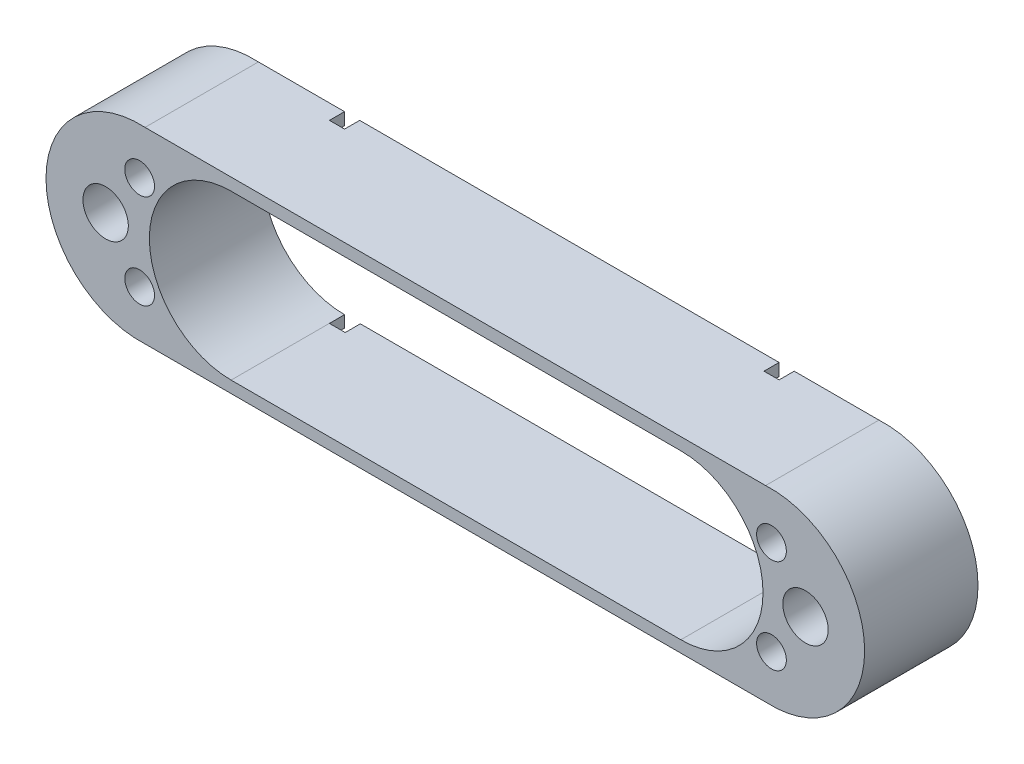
ISO-10303-21;
HEADER;
FILE_DESCRIPTION(('STEP AP214'),'2;1');
FILE_NAME('part.step','',(''),(''),'','','');
FILE_SCHEMA(('AUTOMOTIVE_DESIGN { 1 0 10303 214 1 1 1 1 }'));
ENDSEC;
DATA;
#1=APPLICATION_CONTEXT('core data for automotive mechanical design processes');
#2=APPLICATION_PROTOCOL_DEFINITION('international standard','automotive_design',2000,#1);
#3=PRODUCT_CONTEXT('',#1,'mechanical');
#4=PRODUCT('Part','Part','',(#3));
#5=PRODUCT_RELATED_PRODUCT_CATEGORY('part','',(#4));
#6=PRODUCT_DEFINITION_FORMATION('','',#4);
#7=PRODUCT_DEFINITION_CONTEXT('part definition',#1,'design');
#8=PRODUCT_DEFINITION('design','',#6,#7);
#9=PRODUCT_DEFINITION_SHAPE('','',#8);
#10=(LENGTH_UNIT() NAMED_UNIT(*) SI_UNIT(.MILLI.,.METRE.));
#11=(NAMED_UNIT(*) PLANE_ANGLE_UNIT() SI_UNIT($,.RADIAN.));
#12=(NAMED_UNIT(*) SI_UNIT($,.STERADIAN.) SOLID_ANGLE_UNIT());
#13=UNCERTAINTY_MEASURE_WITH_UNIT(LENGTH_MEASURE(1.E-05),#10,'distance_accuracy_value','');
#14=(GEOMETRIC_REPRESENTATION_CONTEXT(3) GLOBAL_UNCERTAINTY_ASSIGNED_CONTEXT((#13)) GLOBAL_UNIT_ASSIGNED_CONTEXT((#10,
#11,#12)) REPRESENTATION_CONTEXT('',''));
#15=CARTESIAN_POINT('',(0.,0.,0.));
#16=DIRECTION('',(0.,0.,1.));
#17=DIRECTION('',(1.,0.,0.));
#18=AXIS2_PLACEMENT_3D('',#15,#16,#17);
#19=CARTESIAN_POINT('',(23.4796246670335,0.025957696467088,7.62));
#20=DIRECTION('',(0.,0.,-1.));
#21=DIRECTION('',(-1.,0.,0.));
#22=AXIS2_PLACEMENT_3D('',#19,#20,#21);
#23=CYLINDRICAL_SURFACE('',#22,1.524);
#24=CARTESIAN_POINT('',(23.4796246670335,0.025957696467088,7.62));
#25=DIRECTION('',(0.,0.,1.));
#26=DIRECTION('',(1.,0.,0.));
#27=AXIS2_PLACEMENT_3D('',#24,#25,#26);
#28=CIRCLE('',#27,1.524);
#29=CARTESIAN_POINT('',(21.9556246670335,0.025957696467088,7.62));
#30=VERTEX_POINT('',#29);
#31=EDGE_CURVE('E513',#30,#30,#28,.T.);
#32=CARTESIAN_POINT('',(23.4796246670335,0.025957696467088,5.08));
#33=DIRECTION('',(0.,0.,-1.));
#34=DIRECTION('',(-1.,0.,0.));
#35=AXIS2_PLACEMENT_3D('',#32,#33,#34);
#36=CIRCLE('',#35,1.524);
#37=CARTESIAN_POINT('',(21.9556246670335,0.025957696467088,5.08));
#38=VERTEX_POINT('',#37);
#39=EDGE_CURVE('E40',#38,#38,#36,.T.);
#40=CARTESIAN_POINT('',(21.9556246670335,0.025957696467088,7.62));
#41=CARTESIAN_POINT('',(21.9556246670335,0.025957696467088,7.59354166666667));
#42=CARTESIAN_POINT('',(21.9556246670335,0.025957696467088,7.56708333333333));
#43=CARTESIAN_POINT('',(21.9556246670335,0.025957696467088,7.51416666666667));
#44=CARTESIAN_POINT('',(21.9556246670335,0.025957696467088,7.48770833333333));
#45=CARTESIAN_POINT('',(21.9556246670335,0.025957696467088,7.43479166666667));
#46=CARTESIAN_POINT('',(21.9556246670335,0.025957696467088,7.40833333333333));
#47=CARTESIAN_POINT('',(21.9556246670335,0.025957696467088,7.35541666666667));
#48=CARTESIAN_POINT('',(21.9556246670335,0.025957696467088,7.32895833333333));
#49=CARTESIAN_POINT('',(21.9556246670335,0.025957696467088,7.27604166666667));
#50=CARTESIAN_POINT('',(21.9556246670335,0.025957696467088,7.24958333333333));
#51=CARTESIAN_POINT('',(21.9556246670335,0.025957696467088,7.19666666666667));
#52=CARTESIAN_POINT('',(21.9556246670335,0.025957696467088,7.17020833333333));
#53=CARTESIAN_POINT('',(21.9556246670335,0.025957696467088,7.11729166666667));
#54=CARTESIAN_POINT('',(21.9556246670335,0.025957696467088,7.09083333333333));
#55=CARTESIAN_POINT('',(21.9556246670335,0.025957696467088,7.03791666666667));
#56=CARTESIAN_POINT('',(21.9556246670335,0.025957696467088,7.01145833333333));
#57=CARTESIAN_POINT('',(21.9556246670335,0.025957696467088,6.95854166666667));
#58=CARTESIAN_POINT('',(21.9556246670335,0.025957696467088,6.93208333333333));
#59=CARTESIAN_POINT('',(21.9556246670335,0.025957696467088,6.87916666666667));
#60=CARTESIAN_POINT('',(21.9556246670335,0.025957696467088,6.85270833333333));
#61=CARTESIAN_POINT('',(21.9556246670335,0.025957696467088,6.79979166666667));
#62=CARTESIAN_POINT('',(21.9556246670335,0.025957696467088,6.77333333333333));
#63=CARTESIAN_POINT('',(21.9556246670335,0.025957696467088,6.72041666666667));
#64=CARTESIAN_POINT('',(21.9556246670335,0.025957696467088,6.69395833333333));
#65=CARTESIAN_POINT('',(21.9556246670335,0.025957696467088,6.64104166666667));
#66=CARTESIAN_POINT('',(21.9556246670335,0.025957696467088,6.61458333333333));
#67=CARTESIAN_POINT('',(21.9556246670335,0.025957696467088,6.56166666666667));
#68=CARTESIAN_POINT('',(21.9556246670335,0.025957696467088,6.53520833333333));
#69=CARTESIAN_POINT('',(21.9556246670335,0.025957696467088,6.48229166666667));
#70=CARTESIAN_POINT('',(21.9556246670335,0.025957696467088,6.45583333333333));
#71=CARTESIAN_POINT('',(21.9556246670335,0.025957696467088,6.40291666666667));
#72=CARTESIAN_POINT('',(21.9556246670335,0.025957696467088,6.37645833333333));
#73=CARTESIAN_POINT('',(21.9556246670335,0.025957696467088,6.32354166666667));
#74=CARTESIAN_POINT('',(21.9556246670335,0.025957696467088,6.29708333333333));
#75=CARTESIAN_POINT('',(21.9556246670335,0.025957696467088,6.24416666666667));
#76=CARTESIAN_POINT('',(21.9556246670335,0.025957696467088,6.21770833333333));
#77=CARTESIAN_POINT('',(21.9556246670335,0.025957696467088,6.16479166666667));
#78=CARTESIAN_POINT('',(21.9556246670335,0.025957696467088,6.13833333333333));
#79=CARTESIAN_POINT('',(21.9556246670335,0.025957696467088,6.08541666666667));
#80=CARTESIAN_POINT('',(21.9556246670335,0.025957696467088,6.05895833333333));
#81=CARTESIAN_POINT('',(21.9556246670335,0.025957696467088,6.00604166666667));
#82=CARTESIAN_POINT('',(21.9556246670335,0.025957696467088,5.97958333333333));
#83=CARTESIAN_POINT('',(21.9556246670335,0.025957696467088,5.92666666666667));
#84=CARTESIAN_POINT('',(21.9556246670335,0.025957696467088,5.90020833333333));
#85=CARTESIAN_POINT('',(21.9556246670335,0.025957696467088,5.84729166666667));
#86=CARTESIAN_POINT('',(21.9556246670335,0.025957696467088,5.82083333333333));
#87=CARTESIAN_POINT('',(21.9556246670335,0.025957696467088,5.76791666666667));
#88=CARTESIAN_POINT('',(21.9556246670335,0.025957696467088,5.74145833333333));
#89=CARTESIAN_POINT('',(21.9556246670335,0.025957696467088,5.68854166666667));
#90=CARTESIAN_POINT('',(21.9556246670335,0.025957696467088,5.66208333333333));
#91=CARTESIAN_POINT('',(21.9556246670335,0.025957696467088,5.60916666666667));
#92=CARTESIAN_POINT('',(21.9556246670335,0.025957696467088,5.58270833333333));
#93=CARTESIAN_POINT('',(21.9556246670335,0.025957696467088,5.52979166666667));
#94=CARTESIAN_POINT('',(21.9556246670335,0.025957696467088,5.50333333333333));
#95=CARTESIAN_POINT('',(21.9556246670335,0.025957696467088,5.45041666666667));
#96=CARTESIAN_POINT('',(21.9556246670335,0.025957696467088,5.42395833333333));
#97=CARTESIAN_POINT('',(21.9556246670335,0.025957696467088,5.37104166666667));
#98=CARTESIAN_POINT('',(21.9556246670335,0.025957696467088,5.34458333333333));
#99=CARTESIAN_POINT('',(21.9556246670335,0.025957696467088,5.29166666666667));
#100=CARTESIAN_POINT('',(21.9556246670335,0.025957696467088,5.26520833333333));
#101=CARTESIAN_POINT('',(21.9556246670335,0.025957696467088,5.21229166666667));
#102=CARTESIAN_POINT('',(21.9556246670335,0.025957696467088,5.18583333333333));
#103=CARTESIAN_POINT('',(21.9556246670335,0.025957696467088,5.13291666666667));
#104=CARTESIAN_POINT('',(21.9556246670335,0.025957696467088,5.10645833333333));
#105=CARTESIAN_POINT('',(21.9556246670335,0.025957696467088,5.08));
#106=B_SPLINE_CURVE_WITH_KNOTS('',3,(#40,#41,#42,#43,#44,#45,#46,#47,#48,#49,#50,#51,#52,#53,
#54,#55,#56,#57,#58,#59,#60,#61,#62,#63,#64,#65,#66,#67,#68,#69,#70,#71,#72,#73,#74,#75,#76,#77,
#78,#79,#80,#81,#82,#83,#84,#85,#86,#87,#88,#89,#90,#91,#92,#93,#94,#95,#96,#97,#98,#99,#100,
#101,#102,#103,#104,#105),.UNSPECIFIED.,.F.,.F.,(4,2,2,2,2,2,2,2,2,2,2,2,2,2,2,2,2,2,2,2,2,2,2,
2,2,2,2,2,2,2,2,2,4),(0.,0.0793750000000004,0.15875,0.238125,0.3175,0.396875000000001,0.47625,
0.555625,0.635,0.714375,0.79375,0.873125,0.952499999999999,1.031875,1.11125,1.190625,1.27,
1.349375,1.42875,1.508125,1.5875,1.666875,1.74625,1.825625,1.905,1.984375,2.06375,2.143125,
2.2225,2.301875,2.38125,2.460625,2.54),.UNSPECIFIED.);
#107=EDGE_CURVE('BSEAM36',#30,#38,#106,.T.);
#108=ORIENTED_EDGE('',*,*,#31,.T.);
#109=ORIENTED_EDGE('',*,*,#39,.T.);
#110=ORIENTED_EDGE('',*,*,#107,.T.);
#111=ORIENTED_EDGE('',*,*,#107,.F.);
#112=EDGE_LOOP('',(#108,#110,#109,#111));
#113=FACE_BOUND('',#112,.T.);
#114=ADVANCED_FACE('F36',(#113),#23,.F.);
#115=CARTESIAN_POINT('',(-0.0572927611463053,-44.0329281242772,0.));
#116=DIRECTION('',(0.,0.,1.));
#117=DIRECTION('',(1.,0.,0.));
#118=AXIS2_PLACEMENT_3D('',#115,#116,#117);
#119=PLANE('',#118);
#120=DIRECTION('',(0.,-1.,0.));
#121=VECTOR('',#120,1.);
#122=CARTESIAN_POINT('',(-15.1231140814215,0.0203923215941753,0.));
#123=LINE('',#122,#121);
#124=CARTESIAN_POINT('',(-15.1231140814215,-5.4991,0.));
#125=VERTEX_POINT('',#124);
#126=CARTESIAN_POINT('',(-15.1231140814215,-6.28487924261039,0.));
#127=VERTEX_POINT('',#126);
#128=EDGE_CURVE('E419',#125,#127,#123,.T.);
#129=ORIENTED_EDGE('',*,*,#128,.T.);
#130=DIRECTION('',(0.999999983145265,0.000183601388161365,0.));
#131=VECTOR('',#130,1.);
#132=CARTESIAN_POINT('',(-0.0642238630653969,-6.28211440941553,0.));
#133=LINE('',#132,#131);
#134=CARTESIAN_POINT('',(-20.9131623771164,-6.28594230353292,0.));
#135=VERTEX_POINT('',#134);
#136=EDGE_CURVE('E507',#135,#127,#133,.T.);
#137=ORIENTED_EDGE('',*,*,#136,.F.);
#138=CARTESIAN_POINT('',(-21.2574101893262,0.016563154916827,0.));
#139=DIRECTION('',(0.,0.,1.));
#140=DIRECTION('',(1.,0.,0.));
#141=AXIS2_PLACEMENT_3D('',#138,#139,#140);
#142=CIRCLE('',#141,6.3119);
#143=CARTESIAN_POINT('',(-20.9131623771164,6.31906861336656,0.));
#144=VERTEX_POINT('',#143);
#145=EDGE_CURVE('E552',#135,#144,#142,.F.);
#146=ORIENTED_EDGE('',*,*,#145,.T.);
#147=DIRECTION('',(0.999999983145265,0.000183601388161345,0.));
#148=VECTOR('',#147,1.);
#149=CARTESIAN_POINT('',(-0.0665381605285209,6.32289608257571,0.));
#150=LINE('',#149,#148);
#151=CARTESIAN_POINT('',(-15.1231140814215,6.32013167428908,0.));
#152=VERTEX_POINT('',#151);
#153=EDGE_CURVE('E549',#144,#152,#150,.T.);
#154=ORIENTED_EDGE('',*,*,#153,.T.);
#155=DIRECTION('',(0.,-1.,0.));
#156=VECTOR('',#155,1.);
#157=CARTESIAN_POINT('',(-15.1231140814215,0.0203923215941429,0.));
#158=LINE('',#157,#156);
#159=CARTESIAN_POINT('',(-15.1231140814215,5.49910161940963,0.));
#160=VERTEX_POINT('',#159);
#161=EDGE_CURVE('E445',#152,#160,#158,.T.);
#162=ORIENTED_EDGE('',*,*,#161,.T.);
#163=CARTESIAN_POINT('',(-15.1231140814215,0.,0.));
#164=DIRECTION('',(0.,0.,1.));
#165=DIRECTION('',(1.,0.,0.));
#166=AXIS2_PLACEMENT_3D('',#163,#164,#165);
#167=CIRCLE('',#166,5.49910161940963);
#168=CARTESIAN_POINT('',(-15.1273343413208,-5.4991,0.));
#169=VERTEX_POINT('',#168);
#170=EDGE_CURVE('E475',#160,#169,#167,.T.);
#171=ORIENTED_EDGE('',*,*,#170,.T.);
#172=DIRECTION('',(1.,0.,0.));
#173=VECTOR('',#172,1.);
#174=CARTESIAN_POINT('',(-15.1273343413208,-5.4991,0.));
#175=LINE('',#174,#173);
#176=EDGE_CURVE('E478',#169,#125,#175,.T.);
#177=ORIENTED_EDGE('',*,*,#176,.T.);
#178=EDGE_LOOP('',(#129,#137,#146,#154,#162,#171,#177));
#179=FACE_BOUND('',#178,.T.);
#180=CARTESIAN_POINT('',(-21.2751753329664,3.20095769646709,0.));
#181=DIRECTION('',(0.,0.,1.));
#182=DIRECTION('',(1.,0.,0.));
#183=AXIS2_PLACEMENT_3D('',#180,#181,#182);
#184=CIRCLE('',#183,0.999999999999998);
#185=CARTESIAN_POINT('',(-22.2751753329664,3.20095769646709,0.));
#186=VERTEX_POINT('',#185);
#187=EDGE_CURVE('E495',#186,#186,#184,.T.);
#188=ORIENTED_EDGE('',*,*,#187,.T.);
#189=EDGE_LOOP('',(#188));
#190=FACE_BOUND('',#189,.T.);
#191=CARTESIAN_POINT('',(-21.2751753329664,-3.14904230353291,0.));
#192=DIRECTION('',(0.,0.,1.));
#193=DIRECTION('',(1.,0.,0.));
#194=AXIS2_PLACEMENT_3D('',#191,#192,#193);
#195=CIRCLE('',#194,1.);
#196=CARTESIAN_POINT('',(-22.2751753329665,-3.14904230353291,0.));
#197=VERTEX_POINT('',#196);
#198=EDGE_CURVE('E536',#197,#197,#195,.T.);
#199=ORIENTED_EDGE('',*,*,#198,.T.);
#200=EDGE_LOOP('',(#199));
#201=FACE_BOUND('',#200,.T.);
#202=DIRECTION('',(0.866025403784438,0.500000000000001,0.));
#203=VECTOR('',#202,1.);
#204=CARTESIAN_POINT('',(-23.8048205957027,-2.90100336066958,0.));
#205=LINE('',#204,#203);
#206=CARTESIAN_POINT('',(-23.5611753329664,-2.76033470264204,0.));
#207=VERTEX_POINT('',#206);
#208=CARTESIAN_POINT('',(-21.1481753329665,-1.36718850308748,0.));
#209=VERTEX_POINT('',#208);
#210=EDGE_CURVE('E61',#207,#209,#205,.T.);
#211=ORIENTED_EDGE('',*,*,#210,.T.);
#212=DIRECTION('',(0.,1.,0.));
#213=VECTOR('',#212,1.);
#214=CARTESIAN_POINT('',(-21.1481753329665,-44.0329281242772,0.));
#215=LINE('',#214,#213);
#216=CARTESIAN_POINT('',(-21.1481753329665,1.41910389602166,0.));
#217=VERTEX_POINT('',#216);
#218=EDGE_CURVE('E340',#209,#217,#215,.T.);
#219=ORIENTED_EDGE('',*,*,#218,.T.);
#220=DIRECTION('',(-0.866025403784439,0.499999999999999,0.));
#221=VECTOR('',#220,1.);
#222=CARTESIAN_POINT('',(14.3512937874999,-19.0765241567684,0.));
#223=LINE('',#222,#221);
#224=CARTESIAN_POINT('',(-23.5611753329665,2.81225009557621,0.));
#225=VERTEX_POINT('',#224);
#226=EDGE_CURVE('E343',#217,#225,#223,.T.);
#227=ORIENTED_EDGE('',*,*,#226,.T.);
#228=DIRECTION('',(-0.866025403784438,-0.500000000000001,0.));
#229=VECTOR('',#228,1.);
#230=CARTESIAN_POINT('',(-26.2178205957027,1.2784352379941,0.));
#231=LINE('',#230,#229);
#232=CARTESIAN_POINT('',(-25.9741753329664,1.41910389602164,0.));
#233=VERTEX_POINT('',#232);
#234=EDGE_CURVE('E346',#225,#233,#231,.T.);
#235=ORIENTED_EDGE('',*,*,#234,.T.);
#236=DIRECTION('',(0.,-1.,0.));
#237=VECTOR('',#236,1.);
#238=CARTESIAN_POINT('',(-25.9741753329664,-44.0329281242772,0.));
#239=LINE('',#238,#237);
#240=CARTESIAN_POINT('',(-25.9741753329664,-1.36718850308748,0.));
#241=VERTEX_POINT('',#240);
#242=EDGE_CURVE('E349',#233,#241,#239,.T.);
#243=ORIENTED_EDGE('',*,*,#242,.T.);
#244=DIRECTION('',(0.866025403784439,-0.499999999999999,0.));
#245=VECTOR('',#244,1.);
#246=CARTESIAN_POINT('',(11.9382937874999,-23.255962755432,0.));
#247=LINE('',#246,#245);
#248=EDGE_CURVE('E328',#241,#207,#247,.T.);
#249=ORIENTED_EDGE('',*,*,#248,.T.);
#250=EDGE_LOOP('',(#211,#219,#227,#235,#243,#249));
#251=FACE_BOUND('',#250,.T.);
#252=ADVANCED_FACE('F644',(#179,#190,#201,#251),#119,.F.);
#253=CARTESIAN_POINT('',(-0.0642238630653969,-6.28211440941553,7.62));
#254=DIRECTION('',(-0.000183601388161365,0.999999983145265,0.));
#255=DIRECTION('',(-0.999999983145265,-0.000183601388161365,0.));
#256=AXIS2_PLACEMENT_3D('',#253,#254,#255);
#257=PLANE('',#256);
#258=DIRECTION('',(0.,0.,-1.));
#259=VECTOR('',#258,1.);
#260=CARTESIAN_POINT('',(14.085222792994,-6.27951655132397,1.016));
#261=LINE('',#260,#259);
#262=CARTESIAN_POINT('',(14.085222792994,-6.27951655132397,1.016));
#263=VERTEX_POINT('',#262);
#264=CARTESIAN_POINT('',(14.085222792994,-6.27951655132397,0.));
#265=VERTEX_POINT('',#264);
#266=EDGE_CURVE('E383',#263,#265,#261,.T.);
#267=ORIENTED_EDGE('',*,*,#266,.F.);
#268=DIRECTION('',(-0.999999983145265,-0.000183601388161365,0.));
#269=VECTOR('',#268,1.);
#270=CARTESIAN_POINT('',(-27.2522796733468,-6.28710617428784,1.016));
#271=LINE('',#270,#269);
#272=CARTESIAN_POINT('',(15.101222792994,-6.27933001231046,1.016));
#273=VERTEX_POINT('',#272);
#274=EDGE_CURVE('E375',#273,#263,#271,.T.);
#275=ORIENTED_EDGE('',*,*,#274,.F.);
#276=DIRECTION('',(0.,0.,-1.));
#277=VECTOR('',#276,1.);
#278=CARTESIAN_POINT('',(15.101222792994,-6.27933001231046,1.016));
#279=LINE('',#278,#277);
#280=CARTESIAN_POINT('',(15.101222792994,-6.27933001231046,0.));
#281=VERTEX_POINT('',#280);
#282=EDGE_CURVE('E386',#273,#281,#279,.T.);
#283=ORIENTED_EDGE('',*,*,#282,.T.);
#284=CARTESIAN_POINT('',(20.7985768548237,-6.27828397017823,0.));
#285=VERTEX_POINT('',#284);
#286=EDGE_CURVE('E556',#281,#285,#133,.T.);
#287=ORIENTED_EDGE('',*,*,#286,.T.);
#288=DIRECTION('',(0.,0.,-1.));
#289=VECTOR('',#288,1.);
#290=CARTESIAN_POINT('',(20.7985768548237,-6.27828397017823,7.62));
#291=LINE('',#290,#289);
#292=CARTESIAN_POINT('',(20.7985768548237,-6.27828397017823,7.62));
#293=VERTEX_POINT('',#292);
#294=EDGE_CURVE('E533',#293,#285,#291,.T.);
#295=ORIENTED_EDGE('',*,*,#294,.F.);
#296=DIRECTION('',(0.999999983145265,0.000183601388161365,0.));
#297=VECTOR('',#296,1.);
#298=CARTESIAN_POINT('',(-0.0642238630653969,-6.28211440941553,7.62));
#299=LINE('',#298,#297);
#300=CARTESIAN_POINT('',(-20.9131623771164,-6.28594230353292,7.62));
#301=VERTEX_POINT('',#300);
#302=EDGE_CURVE('E531',#301,#293,#299,.T.);
#303=ORIENTED_EDGE('',*,*,#302,.F.);
#304=DIRECTION('',(0.,0.,-1.));
#305=VECTOR('',#304,1.);
#306=CARTESIAN_POINT('',(-20.9131623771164,-6.28594230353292,7.62));
#307=LINE('',#306,#305);
#308=EDGE_CURVE('E562',#301,#135,#307,.T.);
#309=ORIENTED_EDGE('',*,*,#308,.T.);
#310=ORIENTED_EDGE('',*,*,#136,.T.);
#311=DIRECTION('',(0.,0.,-1.));
#312=VECTOR('',#311,1.);
#313=CARTESIAN_POINT('',(-15.1231140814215,-6.28487924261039,1.016));
#314=LINE('',#313,#312);
#315=CARTESIAN_POINT('',(-15.1231140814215,-6.28487924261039,1.016));
#316=VERTEX_POINT('',#315);
#317=EDGE_CURVE('E435',#316,#127,#314,.T.);
#318=ORIENTED_EDGE('',*,*,#317,.F.);
#319=DIRECTION('',(-0.999999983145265,-0.000183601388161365,0.));
#320=VECTOR('',#319,1.);
#321=CARTESIAN_POINT('',(-44.109454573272,-6.29020117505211,1.016));
#322=LINE('',#321,#320);
#323=CARTESIAN_POINT('',(-14.060834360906,-6.2846842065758,1.016));
#324=VERTEX_POINT('',#323);
#325=EDGE_CURVE('E422',#324,#316,#322,.T.);
#326=ORIENTED_EDGE('',*,*,#325,.F.);
#327=DIRECTION('',(0.,0.,-1.));
#328=VECTOR('',#327,1.);
#329=CARTESIAN_POINT('',(-14.060834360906,-6.2846842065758,1.016));
#330=LINE('',#329,#328);
#331=CARTESIAN_POINT('',(-14.060834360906,-6.2846842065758,0.));
#332=VERTEX_POINT('',#331);
#333=EDGE_CURVE('E437',#324,#332,#330,.T.);
#334=ORIENTED_EDGE('',*,*,#333,.T.);
#335=EDGE_CURVE('E559',#332,#265,#133,.T.);
#336=ORIENTED_EDGE('',*,*,#335,.T.);
#337=EDGE_LOOP('',(#267,#275,#283,#287,#295,#303,#309,#310,#318,#326,#334,#336));
#338=FACE_BOUND('',#337,.T.);
#339=ADVANCED_FACE('F609',(#338),#257,.F.);
#340=CARTESIAN_POINT('',(-15.1273343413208,-5.4991,0.));
#341=DIRECTION('',(0.,-1.,0.));
#342=DIRECTION('',(1.,0.,0.));
#343=AXIS2_PLACEMENT_3D('',#340,#341,#342);
#344=PLANE('',#343);
#345=DIRECTION('',(0.,0.,-1.));
#346=VECTOR('',#345,1.);
#347=CARTESIAN_POINT('',(14.085222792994,-5.4991,1.016));
#348=LINE('',#347,#346);
#349=CARTESIAN_POINT('',(14.085222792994,-5.4991,1.016));
#350=VERTEX_POINT('',#349);
#351=CARTESIAN_POINT('',(14.085222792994,-5.4991,0.));
#352=VERTEX_POINT('',#351);
#353=EDGE_CURVE('E378',#350,#352,#348,.T.);
#354=ORIENTED_EDGE('',*,*,#353,.T.);
#355=CARTESIAN_POINT('',(-14.060834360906,-5.4991,0.));
#356=VERTEX_POINT('',#355);
#357=EDGE_CURVE('E482',#356,#352,#175,.T.);
#358=ORIENTED_EDGE('',*,*,#357,.F.);
#359=DIRECTION('',(0.,0.,-1.));
#360=VECTOR('',#359,1.);
#361=CARTESIAN_POINT('',(-14.060834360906,-5.4991,1.016));
#362=LINE('',#361,#360);
#363=CARTESIAN_POINT('',(-14.060834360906,-5.4991,1.016));
#364=VERTEX_POINT('',#363);
#365=EDGE_CURVE('E427',#364,#356,#362,.T.);
#366=ORIENTED_EDGE('',*,*,#365,.F.);
#367=DIRECTION('',(1.,0.,0.));
#368=VECTOR('',#367,1.);
#369=CARTESIAN_POINT('',(-44.1106132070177,-5.4991,1.016));
#370=LINE('',#369,#368);
#371=CARTESIAN_POINT('',(-15.1231140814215,-5.4991,1.016));
#372=VERTEX_POINT('',#371);
#373=EDGE_CURVE('E415',#372,#364,#370,.T.);
#374=ORIENTED_EDGE('',*,*,#373,.F.);
#375=DIRECTION('',(0.,0.,-1.));
#376=VECTOR('',#375,1.);
#377=CARTESIAN_POINT('',(-15.1231140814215,-5.4991,1.016));
#378=LINE('',#377,#376);
#379=EDGE_CURVE('E431',#372,#125,#378,.T.);
#380=ORIENTED_EDGE('',*,*,#379,.T.);
#381=ORIENTED_EDGE('',*,*,#176,.F.);
#382=DIRECTION('',(0.,0.,1.));
#383=VECTOR('',#382,1.);
#384=CARTESIAN_POINT('',(-15.1273343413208,-5.4991,0.));
#385=LINE('',#384,#383);
#386=CARTESIAN_POINT('',(-15.1273343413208,-5.4991,7.62));
#387=VERTEX_POINT('',#386);
#388=EDGE_CURVE('E496',#169,#387,#385,.T.);
#389=ORIENTED_EDGE('',*,*,#388,.T.);
#390=DIRECTION('',(1.,0.,0.));
#391=VECTOR('',#390,1.);
#392=CARTESIAN_POINT('',(-15.1273343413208,-5.4991,7.62));
#393=LINE('',#392,#391);
#394=CARTESIAN_POINT('',(15.102248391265,-5.4991,7.62));
#395=VERTEX_POINT('',#394);
#396=EDGE_CURVE('E473',#387,#395,#393,.T.);
#397=ORIENTED_EDGE('',*,*,#396,.T.);
#398=DIRECTION('',(0.,0.,1.));
#399=VECTOR('',#398,1.);
#400=CARTESIAN_POINT('',(15.102248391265,-5.4991,0.));
#401=LINE('',#400,#399);
#402=CARTESIAN_POINT('',(15.102248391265,-5.4991,0.));
#403=VERTEX_POINT('',#402);
#404=EDGE_CURVE('E493',#403,#395,#401,.T.);
#405=ORIENTED_EDGE('',*,*,#404,.F.);
#406=CARTESIAN_POINT('',(15.101222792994,-5.4991,0.));
#407=VERTEX_POINT('',#406);
#408=EDGE_CURVE('E477',#407,#403,#175,.T.);
#409=ORIENTED_EDGE('',*,*,#408,.F.);
#410=DIRECTION('',(0.,0.,-1.));
#411=VECTOR('',#410,1.);
#412=CARTESIAN_POINT('',(15.101222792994,-5.4991,1.016));
#413=LINE('',#412,#411);
#414=CARTESIAN_POINT('',(15.101222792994,-5.4991,1.016));
#415=VERTEX_POINT('',#414);
#416=EDGE_CURVE('E389',#415,#407,#413,.T.);
#417=ORIENTED_EDGE('',*,*,#416,.F.);
#418=DIRECTION('',(1.,0.,0.));
#419=VECTOR('',#418,1.);
#420=CARTESIAN_POINT('',(-27.2534384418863,-5.4991,1.016));
#421=LINE('',#420,#419);
#422=EDGE_CURVE('E368',#350,#415,#421,.T.);
#423=ORIENTED_EDGE('',*,*,#422,.F.);
#424=EDGE_LOOP('',(#354,#358,#366,#374,#380,#381,#389,#397,#405,#409,#417,#423));
#425=FACE_BOUND('',#424,.T.);
#426=ADVANCED_FACE('F670',(#425),#344,.F.);
#427=DIRECTION('',(0.,-1.,0.));
#428=VECTOR('',#427,1.);
#429=CARTESIAN_POINT('',(14.085222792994,0.0242214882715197,0.));
#430=LINE('',#429,#428);
#431=EDGE_CURVE('E379',#352,#265,#430,.T.);
#432=ORIENTED_EDGE('',*,*,#431,.T.);
#433=ORIENTED_EDGE('',*,*,#335,.F.);
#434=DIRECTION('',(0.,-1.,0.));
#435=VECTOR('',#434,1.);
#436=CARTESIAN_POINT('',(-14.060834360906,0.0203923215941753,0.));
#437=LINE('',#436,#435);
#438=EDGE_CURVE('E410',#356,#332,#437,.T.);
#439=ORIENTED_EDGE('',*,*,#438,.F.);
#440=ORIENTED_EDGE('',*,*,#357,.T.);
#441=EDGE_LOOP('',(#432,#433,#439,#440));
#442=FACE_BOUND('',#441,.T.);
#443=ADVANCED_FACE('F662',(#442),#119,.F.);
#444=CARTESIAN_POINT('',(-0.0665381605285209,6.32289608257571,7.62));
#445=DIRECTION('',(-0.000183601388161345,0.999999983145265,0.));
#446=DIRECTION('',(-0.999999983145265,-0.000183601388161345,0.));
#447=AXIS2_PLACEMENT_3D('',#444,#445,#446);
#448=PLANE('',#447);
#449=DIRECTION('',(0.999999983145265,0.000183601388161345,0.));
#450=VECTOR('',#449,1.);
#451=CARTESIAN_POINT('',(-27.2545939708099,6.3179043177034,1.016));
#452=LINE('',#451,#450);
#453=CARTESIAN_POINT('',(14.085222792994,6.3254943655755,1.016));
#454=VERTEX_POINT('',#453);
#455=CARTESIAN_POINT('',(15.101222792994,6.32568090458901,1.016));
#456=VERTEX_POINT('',#455);
#457=EDGE_CURVE('E395',#454,#456,#452,.T.);
#458=ORIENTED_EDGE('',*,*,#457,.F.);
#459=DIRECTION('',(0.,0.,-1.));
#460=VECTOR('',#459,1.);
#461=CARTESIAN_POINT('',(14.085222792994,6.3254943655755,1.016));
#462=LINE('',#461,#460);
#463=CARTESIAN_POINT('',(14.085222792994,6.3254943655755,0.));
#464=VERTEX_POINT('',#463);
#465=EDGE_CURVE('E404',#454,#464,#462,.T.);
#466=ORIENTED_EDGE('',*,*,#465,.T.);
#467=CARTESIAN_POINT('',(-14.1071140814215,6.3203182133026,0.));
#468=VERTEX_POINT('',#467);
#469=EDGE_CURVE('E553',#468,#464,#150,.T.);
#470=ORIENTED_EDGE('',*,*,#469,.F.);
#471=DIRECTION('',(0.,0.,-1.));
#472=VECTOR('',#471,1.);
#473=CARTESIAN_POINT('',(-14.1071140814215,6.3203182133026,1.016));
#474=LINE('',#473,#472);
#475=CARTESIAN_POINT('',(-14.1071140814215,6.3203182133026,1.016));
#476=VERTEX_POINT('',#475);
#477=EDGE_CURVE('E454',#476,#468,#474,.T.);
#478=ORIENTED_EDGE('',*,*,#477,.F.);
#479=DIRECTION('',(0.999999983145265,0.000183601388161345,0.));
#480=VECTOR('',#479,1.);
#481=CARTESIAN_POINT('',(-44.1117688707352,6.31480931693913,1.016));
#482=LINE('',#481,#480);
#483=CARTESIAN_POINT('',(-15.1231140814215,6.32013167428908,1.016));
#484=VERTEX_POINT('',#483);
#485=EDGE_CURVE('E441',#484,#476,#482,.T.);
#486=ORIENTED_EDGE('',*,*,#485,.F.);
#487=DIRECTION('',(0.,0.,-1.));
#488=VECTOR('',#487,1.);
#489=CARTESIAN_POINT('',(-15.1231140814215,6.32013167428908,1.016));
#490=LINE('',#489,#488);
#491=EDGE_CURVE('E459',#484,#152,#490,.T.);
#492=ORIENTED_EDGE('',*,*,#491,.T.);
#493=ORIENTED_EDGE('',*,*,#153,.F.);
#494=DIRECTION('',(0.,0.,-1.));
#495=VECTOR('',#494,1.);
#496=CARTESIAN_POINT('',(-20.9131623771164,6.31906861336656,7.62));
#497=LINE('',#496,#495);
#498=CARTESIAN_POINT('',(-20.9131623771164,6.31906861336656,7.62));
#499=VERTEX_POINT('',#498);
#500=EDGE_CURVE('E45',#499,#144,#497,.T.);
#501=ORIENTED_EDGE('',*,*,#500,.F.);
#502=DIRECTION('',(0.999999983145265,0.000183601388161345,0.));
#503=VECTOR('',#502,1.);
#504=CARTESIAN_POINT('',(-0.0665381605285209,6.32289608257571,7.62));
#505=LINE('',#504,#503);
#506=CARTESIAN_POINT('',(20.7985768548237,6.32672694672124,7.62));
#507=VERTEX_POINT('',#506);
#508=EDGE_CURVE('E525',#499,#507,#505,.T.);
#509=ORIENTED_EDGE('',*,*,#508,.T.);
#510=DIRECTION('',(0.,0.,-1.));
#511=VECTOR('',#510,1.);
#512=CARTESIAN_POINT('',(20.7985768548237,6.32672694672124,7.62));
#513=LINE('',#512,#511);
#514=CARTESIAN_POINT('',(20.7985768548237,6.32672694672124,0.));
#515=VERTEX_POINT('',#514);
#516=EDGE_CURVE('E11',#507,#515,#513,.T.);
#517=ORIENTED_EDGE('',*,*,#516,.T.);
#518=CARTESIAN_POINT('',(15.101222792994,6.32568090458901,0.));
#519=VERTEX_POINT('',#518);
#520=EDGE_CURVE('E548',#519,#515,#150,.T.);
#521=ORIENTED_EDGE('',*,*,#520,.F.);
#522=DIRECTION('',(0.,0.,-1.));
#523=VECTOR('',#522,1.);
#524=CARTESIAN_POINT('',(15.101222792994,6.32568090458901,1.016));
#525=LINE('',#524,#523);
#526=EDGE_CURVE('E411',#456,#519,#525,.T.);
#527=ORIENTED_EDGE('',*,*,#526,.F.);
#528=EDGE_LOOP('',(#458,#466,#470,#478,#486,#492,#493,#501,#509,#517,#521,#527));
#529=FACE_BOUND('',#528,.T.);
#530=ADVANCED_FACE('F599',(#529),#448,.T.);
#531=DIRECTION('',(0.,-1.,0.));
#532=VECTOR('',#531,1.);
#533=CARTESIAN_POINT('',(14.085222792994,0.0242214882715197,0.));
#534=LINE('',#533,#532);
#535=CARTESIAN_POINT('',(14.085222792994,5.4991,0.));
#536=VERTEX_POINT('',#535);
#537=EDGE_CURVE('E385',#464,#536,#534,.T.);
#538=ORIENTED_EDGE('',*,*,#537,.T.);
#539=DIRECTION('',(-1.,0.,0.));
#540=VECTOR('',#539,1.);
#541=CARTESIAN_POINT('',(15.101222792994,5.4991,0.));
#542=LINE('',#541,#540);
#543=CARTESIAN_POINT('',(-14.1071140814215,5.4991,0.));
#544=VERTEX_POINT('',#543);
#545=EDGE_CURVE('E472',#536,#544,#542,.T.);
#546=ORIENTED_EDGE('',*,*,#545,.T.);
#547=DIRECTION('',(0.,-1.,0.));
#548=VECTOR('',#547,1.);
#549=CARTESIAN_POINT('',(-14.1071140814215,0.0203923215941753,0.));
#550=LINE('',#549,#548);
#551=EDGE_CURVE('E434',#468,#544,#550,.T.);
#552=ORIENTED_EDGE('',*,*,#551,.F.);
#553=ORIENTED_EDGE('',*,*,#469,.T.);
#554=EDGE_LOOP('',(#538,#546,#552,#553));
#555=FACE_BOUND('',#554,.T.);
#556=ADVANCED_FACE('F621',(#555),#119,.F.);
#557=CARTESIAN_POINT('',(15.101222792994,5.4991,0.));
#558=DIRECTION('',(0.,1.,0.));
#559=DIRECTION('',(0.,0.,1.));
#560=AXIS2_PLACEMENT_3D('',#557,#558,#559);
#561=PLANE('',#560);
#562=DIRECTION('',(0.,0.,-1.));
#563=VECTOR('',#562,1.);
#564=CARTESIAN_POINT('',(14.085222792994,5.4991,1.016));
#565=LINE('',#564,#563);
#566=CARTESIAN_POINT('',(14.085222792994,5.4991,1.016));
#567=VERTEX_POINT('',#566);
#568=EDGE_CURVE('E408',#567,#536,#565,.T.);
#569=ORIENTED_EDGE('',*,*,#568,.F.);
#570=DIRECTION('',(-1.,0.,0.));
#571=VECTOR('',#570,1.);
#572=CARTESIAN_POINT('',(-27.2534384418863,5.4991,1.016));
#573=LINE('',#572,#571);
#574=CARTESIAN_POINT('',(15.101222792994,5.4991,1.016));
#575=VERTEX_POINT('',#574);
#576=EDGE_CURVE('E401',#575,#567,#573,.T.);
#577=ORIENTED_EDGE('',*,*,#576,.F.);
#578=DIRECTION('',(0.,0.,1.));
#579=VECTOR('',#578,1.);
#580=CARTESIAN_POINT('',(15.101222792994,5.4991,0.));
#581=LINE('',#580,#579);
#582=CARTESIAN_POINT('',(15.101222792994,5.4991,7.62));
#583=VERTEX_POINT('',#582);
#584=EDGE_CURVE('E481',#575,#583,#581,.T.);
#585=ORIENTED_EDGE('',*,*,#584,.T.);
#586=DIRECTION('',(-1.,0.,0.));
#587=VECTOR('',#586,1.);
#588=CARTESIAN_POINT('',(15.101222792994,5.4991,7.62));
#589=LINE('',#588,#587);
#590=CARTESIAN_POINT('',(-15.1188938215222,5.4991,7.62));
#591=VERTEX_POINT('',#590);
#592=EDGE_CURVE('E485',#583,#591,#589,.T.);
#593=ORIENTED_EDGE('',*,*,#592,.T.);
#594=DIRECTION('',(0.,0.,1.));
#595=VECTOR('',#594,1.);
#596=CARTESIAN_POINT('',(-15.1188938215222,5.4991,0.));
#597=LINE('',#596,#595);
#598=CARTESIAN_POINT('',(-15.1188938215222,5.4991,1.016));
#599=VERTEX_POINT('',#598);
#600=EDGE_CURVE('E498',#599,#591,#597,.T.);
#601=ORIENTED_EDGE('',*,*,#600,.F.);
#602=DIRECTION('',(-1.,0.,0.));
#603=VECTOR('',#602,1.);
#604=CARTESIAN_POINT('',(-44.1106132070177,5.4991,1.016));
#605=LINE('',#604,#603);
#606=CARTESIAN_POINT('',(-14.1071140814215,5.4991,1.016));
#607=VERTEX_POINT('',#606);
#608=EDGE_CURVE('E447',#607,#599,#605,.T.);
#609=ORIENTED_EDGE('',*,*,#608,.F.);
#610=DIRECTION('',(0.,0.,-1.));
#611=VECTOR('',#610,1.);
#612=CARTESIAN_POINT('',(-14.1071140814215,5.4991,1.016));
#613=LINE('',#612,#611);
#614=EDGE_CURVE('E465',#607,#544,#613,.T.);
#615=ORIENTED_EDGE('',*,*,#614,.T.);
#616=ORIENTED_EDGE('',*,*,#545,.F.);
#617=EDGE_LOOP('',(#569,#577,#585,#593,#601,#609,#615,#616));
#618=FACE_BOUND('',#617,.T.);
#619=ADVANCED_FACE('F634',(#618),#561,.F.);
#620=DIRECTION('',(0.,1.,0.));
#621=VECTOR('',#620,1.);
#622=CARTESIAN_POINT('',(21.0666246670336,-44.0329281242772,0.));
#623=LINE('',#622,#621);
#624=CARTESIAN_POINT('',(21.0666246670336,-1.36718850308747,0.));
#625=VERTEX_POINT('',#624);
#626=CARTESIAN_POINT('',(21.0666246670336,1.41910389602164,0.));
#627=VERTEX_POINT('',#626);
#628=EDGE_CURVE('E305',#625,#627,#623,.T.);
#629=ORIENTED_EDGE('',*,*,#628,.F.);
#630=DIRECTION('',(-0.866025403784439,0.5,0.));
#631=VECTOR('',#630,1.);
#632=CARTESIAN_POINT('',(23.6984937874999,-2.88669884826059,0.));
#633=LINE('',#632,#631);
#634=CARTESIAN_POINT('',(23.4796246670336,-2.76033470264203,0.));
#635=VERTEX_POINT('',#634);
#636=EDGE_CURVE('E53',#635,#625,#633,.T.);
#637=ORIENTED_EDGE('',*,*,#636,.F.);
#638=DIRECTION('',(-0.866025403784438,-0.500000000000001,0.));
#639=VECTOR('',#638,1.);
#640=CARTESIAN_POINT('',(-12.0446205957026,-23.2702672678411,0.));
#641=LINE('',#640,#639);
#642=CARTESIAN_POINT('',(25.8926246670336,-1.36718850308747,0.));
#643=VERTEX_POINT('',#642);
#644=EDGE_CURVE('E291',#643,#635,#641,.T.);
#645=ORIENTED_EDGE('',*,*,#644,.F.);
#646=DIRECTION('',(0.,-1.,0.));
#647=VECTOR('',#646,1.);
#648=CARTESIAN_POINT('',(25.8926246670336,-44.0329281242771,0.));
#649=LINE('',#648,#647);
#650=CARTESIAN_POINT('',(25.8926246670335,1.41910389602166,0.));
#651=VERTEX_POINT('',#650);
#652=EDGE_CURVE('E294',#651,#643,#649,.T.);
#653=ORIENTED_EDGE('',*,*,#652,.F.);
#654=DIRECTION('',(0.866025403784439,-0.499999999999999,0.));
#655=VECTOR('',#654,1.);
#656=CARTESIAN_POINT('',(26.1114937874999,1.29273975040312,0.));
#657=LINE('',#656,#655);
#658=CARTESIAN_POINT('',(23.4796246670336,2.81225009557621,0.));
#659=VERTEX_POINT('',#658);
#660=EDGE_CURVE('E310',#659,#651,#657,.T.);
#661=ORIENTED_EDGE('',*,*,#660,.F.);
#662=DIRECTION('',(0.866025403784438,0.5,0.));
#663=VECTOR('',#662,1.);
#664=CARTESIAN_POINT('',(-14.4576205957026,-19.0908286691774,0.));
#665=LINE('',#664,#663);
#666=EDGE_CURVE('E307',#627,#659,#665,.T.);
#667=ORIENTED_EDGE('',*,*,#666,.F.);
#668=EDGE_LOOP('',(#629,#637,#645,#653,#661,#667));
#669=FACE_BOUND('',#668,.T.);
#670=CARTESIAN_POINT('',(21.1936246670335,-3.14904230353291,0.));
#671=DIRECTION('',(0.,0.,1.));
#672=DIRECTION('',(1.,0.,0.));
#673=AXIS2_PLACEMENT_3D('',#670,#671,#672);
#674=CIRCLE('',#673,1.);
#675=CARTESIAN_POINT('',(20.1936246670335,-3.14904230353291,0.));
#676=VERTEX_POINT('',#675);
#677=EDGE_CURVE('E542',#676,#676,#674,.T.);
#678=ORIENTED_EDGE('',*,*,#677,.T.);
#679=EDGE_LOOP('',(#678));
#680=FACE_BOUND('',#679,.T.);
#681=CARTESIAN_POINT('',(21.1936246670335,3.20095769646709,0.));
#682=DIRECTION('',(0.,0.,1.));
#683=DIRECTION('',(1.,0.,0.));
#684=AXIS2_PLACEMENT_3D('',#681,#682,#683);
#685=CIRCLE('',#684,0.999999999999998);
#686=CARTESIAN_POINT('',(20.1936246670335,3.20095769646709,0.));
#687=VERTEX_POINT('',#686);
#688=EDGE_CURVE('E539',#687,#687,#685,.T.);
#689=ORIENTED_EDGE('',*,*,#688,.T.);
#690=EDGE_LOOP('',(#689));
#691=FACE_BOUND('',#690,.T.);
#692=ORIENTED_EDGE('',*,*,#286,.F.);
#693=DIRECTION('',(0.,-1.,0.));
#694=VECTOR('',#693,1.);
#695=CARTESIAN_POINT('',(15.101222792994,0.0242214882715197,0.));
#696=LINE('',#695,#694);
#697=EDGE_CURVE('E369',#407,#281,#696,.T.);
#698=ORIENTED_EDGE('',*,*,#697,.F.);
#699=ORIENTED_EDGE('',*,*,#408,.T.);
#700=CARTESIAN_POINT('',(15.1257820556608,2.24236797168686E-06,0.));
#701=DIRECTION('',(0.,0.,1.));
#702=DIRECTION('',(1.,0.,0.));
#703=AXIS2_PLACEMENT_3D('',#700,#701,#702);
#704=CIRCLE('',#703,5.49915259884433);
#705=CARTESIAN_POINT('',(15.101222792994,5.4991,0.));
#706=VERTEX_POINT('',#705);
#707=EDGE_CURVE('E469',#403,#706,#704,.T.);
#708=ORIENTED_EDGE('',*,*,#707,.T.);
#709=DIRECTION('',(0.,-1.,0.));
#710=VECTOR('',#709,1.);
#711=CARTESIAN_POINT('',(15.101222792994,0.0242214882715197,0.));
#712=LINE('',#711,#710);
#713=EDGE_CURVE('E396',#519,#706,#712,.T.);
#714=ORIENTED_EDGE('',*,*,#713,.F.);
#715=ORIENTED_EDGE('',*,*,#520,.T.);
#716=CARTESIAN_POINT('',(21.1428246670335,0.0242214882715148,0.));
#717=DIRECTION('',(0.,0.,1.));
#718=DIRECTION('',(1.,0.,0.));
#719=AXIS2_PLACEMENT_3D('',#716,#717,#718);
#720=CIRCLE('',#719,6.3119);
#721=EDGE_CURVE('E545',#515,#285,#720,.F.);
#722=ORIENTED_EDGE('',*,*,#721,.T.);
#723=EDGE_LOOP('',(#692,#698,#699,#708,#714,#715,#722));
#724=FACE_BOUND('',#723,.T.);
#725=ADVANCED_FACE('F613',(#669,#680,#691,#724),#119,.F.);
#726=CARTESIAN_POINT('',(-15.1231140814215,0.,0.));
#727=DIRECTION('',(0.,0.,1.));
#728=DIRECTION('',(1.,0.,0.));
#729=AXIS2_PLACEMENT_3D('',#726,#727,#728);
#730=CYLINDRICAL_SURFACE('',#729,5.49910161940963);
#731=DIRECTION('',(0.,0.,-1.));
#732=VECTOR('',#731,1.);
#733=CARTESIAN_POINT('',(-15.1231140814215,5.49910161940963,1.016));
#734=LINE('',#733,#732);
#735=CARTESIAN_POINT('',(-15.1231140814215,5.49910161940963,1.016));
#736=VERTEX_POINT('',#735);
#737=EDGE_CURVE('E463',#736,#160,#734,.T.);
#738=ORIENTED_EDGE('',*,*,#737,.F.);
#739=CARTESIAN_POINT('',(-15.1231140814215,0.,1.016));
#740=DIRECTION('',(0.,0.,-1.));
#741=DIRECTION('',(-1.,0.,0.));
#742=AXIS2_PLACEMENT_3D('',#739,#740,#741);
#743=CIRCLE('',#742,5.49910161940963);
#744=EDGE_CURVE('E449',#599,#736,#743,.F.);
#745=ORIENTED_EDGE('',*,*,#744,.F.);
#746=ORIENTED_EDGE('',*,*,#600,.T.);
#747=CARTESIAN_POINT('',(-15.1231140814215,0.,7.62));
#748=DIRECTION('',(0.,0.,1.));
#749=DIRECTION('',(1.,0.,0.));
#750=AXIS2_PLACEMENT_3D('',#747,#748,#749);
#751=CIRCLE('',#750,5.49910161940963);
#752=EDGE_CURVE('E488',#591,#387,#751,.T.);
#753=ORIENTED_EDGE('',*,*,#752,.T.);
#754=ORIENTED_EDGE('',*,*,#388,.F.);
#755=ORIENTED_EDGE('',*,*,#170,.F.);
#756=EDGE_LOOP('',(#738,#745,#746,#753,#754,#755));
#757=FACE_BOUND('',#756,.T.);
#758=ADVANCED_FACE('F843',(#757),#730,.F.);
#759=CARTESIAN_POINT('',(21.1428246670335,0.0242214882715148,7.62));
#760=DIRECTION('',(0.,0.,-1.));
#761=DIRECTION('',(-1.,0.,0.));
#762=AXIS2_PLACEMENT_3D('',#759,#760,#761);
#763=CYLINDRICAL_SURFACE('',#762,6.3119);
#764=ORIENTED_EDGE('',*,*,#721,.F.);
#765=ORIENTED_EDGE('',*,*,#516,.F.);
#766=CARTESIAN_POINT('',(21.1428246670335,0.0242214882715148,7.62));
#767=DIRECTION('',(0.,0.,1.));
#768=DIRECTION('',(1.,0.,0.));
#769=AXIS2_PLACEMENT_3D('',#766,#767,#768);
#770=CIRCLE('',#769,6.3119);
#771=EDGE_CURVE('E522',#507,#293,#770,.F.);
#772=ORIENTED_EDGE('',*,*,#771,.T.);
#773=ORIENTED_EDGE('',*,*,#294,.T.);
#774=EDGE_LOOP('',(#764,#765,#772,#773));
#775=FACE_BOUND('',#774,.T.);
#776=ADVANCED_FACE('F611',(#775),#763,.T.);
#777=CARTESIAN_POINT('',(-21.2574101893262,0.016563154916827,7.62));
#778=DIRECTION('',(0.,0.,-1.));
#779=DIRECTION('',(-1.,0.,0.));
#780=AXIS2_PLACEMENT_3D('',#777,#778,#779);
#781=CYLINDRICAL_SURFACE('',#780,6.3119);
#782=ORIENTED_EDGE('',*,*,#145,.F.);
#783=ORIENTED_EDGE('',*,*,#308,.F.);
#784=CARTESIAN_POINT('',(-21.2574101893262,0.016563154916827,7.62));
#785=DIRECTION('',(0.,0.,1.));
#786=DIRECTION('',(1.,0.,0.));
#787=AXIS2_PLACEMENT_3D('',#784,#785,#786);
#788=CIRCLE('',#787,6.3119);
#789=EDGE_CURVE('E528',#301,#499,#788,.F.);
#790=ORIENTED_EDGE('',*,*,#789,.T.);
#791=ORIENTED_EDGE('',*,*,#500,.T.);
#792=EDGE_LOOP('',(#782,#783,#790,#791));
#793=FACE_BOUND('',#792,.T.);
#794=ADVANCED_FACE('F605',(#793),#781,.T.);
#795=CARTESIAN_POINT('',(21.1936246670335,-3.14904230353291,7.62));
#796=DIRECTION('',(0.,0.,-1.));
#797=DIRECTION('',(-1.,0.,0.));
#798=AXIS2_PLACEMENT_3D('',#795,#796,#797);
#799=CYLINDRICAL_SURFACE('',#798,1.);
#800=CARTESIAN_POINT('',(21.1936246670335,-3.14904230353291,7.62));
#801=DIRECTION('',(0.,0.,1.));
#802=DIRECTION('',(1.,0.,0.));
#803=AXIS2_PLACEMENT_3D('',#800,#801,#802);
#804=CIRCLE('',#803,1.);
#805=CARTESIAN_POINT('',(20.1936246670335,-3.14904230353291,7.62));
#806=VERTEX_POINT('',#805);
#807=EDGE_CURVE('E519',#806,#806,#804,.T.);
#808=CARTESIAN_POINT('',(20.1936246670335,-3.14904230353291,7.62));
#809=CARTESIAN_POINT('',(20.1936246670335,-3.14904230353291,7.540625));
#810=CARTESIAN_POINT('',(20.1936246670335,-3.14904230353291,7.46125));
#811=CARTESIAN_POINT('',(20.1936246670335,-3.14904230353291,7.3025));
#812=CARTESIAN_POINT('',(20.1936246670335,-3.14904230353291,7.223125));
#813=CARTESIAN_POINT('',(20.1936246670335,-3.14904230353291,7.064375));
#814=CARTESIAN_POINT('',(20.1936246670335,-3.14904230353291,6.985));
#815=CARTESIAN_POINT('',(20.1936246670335,-3.14904230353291,6.82625));
#816=CARTESIAN_POINT('',(20.1936246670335,-3.14904230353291,6.746875));
#817=CARTESIAN_POINT('',(20.1936246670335,-3.14904230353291,6.588125));
#818=CARTESIAN_POINT('',(20.1936246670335,-3.14904230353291,6.50875));
#819=CARTESIAN_POINT('',(20.1936246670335,-3.14904230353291,6.35));
#820=CARTESIAN_POINT('',(20.1936246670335,-3.14904230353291,6.270625));
#821=CARTESIAN_POINT('',(20.1936246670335,-3.14904230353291,6.111875));
#822=CARTESIAN_POINT('',(20.1936246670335,-3.14904230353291,6.0325));
#823=CARTESIAN_POINT('',(20.1936246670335,-3.14904230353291,5.87375));
#824=CARTESIAN_POINT('',(20.1936246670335,-3.14904230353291,5.794375));
#825=CARTESIAN_POINT('',(20.1936246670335,-3.14904230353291,5.635625));
#826=CARTESIAN_POINT('',(20.1936246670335,-3.14904230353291,5.55625));
#827=CARTESIAN_POINT('',(20.1936246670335,-3.14904230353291,5.3975));
#828=CARTESIAN_POINT('',(20.1936246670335,-3.14904230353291,5.318125));
#829=CARTESIAN_POINT('',(20.1936246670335,-3.14904230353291,5.159375));
#830=CARTESIAN_POINT('',(20.1936246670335,-3.14904230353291,5.08));
#831=CARTESIAN_POINT('',(20.1936246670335,-3.14904230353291,4.92125));
#832=CARTESIAN_POINT('',(20.1936246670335,-3.14904230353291,4.841875));
#833=CARTESIAN_POINT('',(20.1936246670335,-3.14904230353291,4.683125));
#834=CARTESIAN_POINT('',(20.1936246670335,-3.14904230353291,4.60375));
#835=CARTESIAN_POINT('',(20.1936246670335,-3.14904230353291,4.445));
#836=CARTESIAN_POINT('',(20.1936246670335,-3.14904230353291,4.365625));
#837=CARTESIAN_POINT('',(20.1936246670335,-3.14904230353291,4.206875));
#838=CARTESIAN_POINT('',(20.1936246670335,-3.14904230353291,4.1275));
#839=CARTESIAN_POINT('',(20.1936246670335,-3.14904230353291,3.96875));
#840=CARTESIAN_POINT('',(20.1936246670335,-3.14904230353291,3.889375));
#841=CARTESIAN_POINT('',(20.1936246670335,-3.14904230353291,3.730625));
#842=CARTESIAN_POINT('',(20.1936246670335,-3.14904230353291,3.65125));
#843=CARTESIAN_POINT('',(20.1936246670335,-3.14904230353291,3.4925));
#844=CARTESIAN_POINT('',(20.1936246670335,-3.14904230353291,3.413125));
#845=CARTESIAN_POINT('',(20.1936246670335,-3.14904230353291,3.254375));
#846=CARTESIAN_POINT('',(20.1936246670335,-3.14904230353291,3.175));
#847=CARTESIAN_POINT('',(20.1936246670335,-3.14904230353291,3.01625));
#848=CARTESIAN_POINT('',(20.1936246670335,-3.14904230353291,2.936875));
#849=CARTESIAN_POINT('',(20.1936246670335,-3.14904230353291,2.778125));
#850=CARTESIAN_POINT('',(20.1936246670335,-3.14904230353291,2.69875));
#851=CARTESIAN_POINT('',(20.1936246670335,-3.14904230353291,2.54));
#852=CARTESIAN_POINT('',(20.1936246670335,-3.14904230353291,2.460625));
#853=CARTESIAN_POINT('',(20.1936246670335,-3.14904230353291,2.301875));
#854=CARTESIAN_POINT('',(20.1936246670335,-3.14904230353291,2.2225));
#855=CARTESIAN_POINT('',(20.1936246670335,-3.14904230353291,2.06375));
#856=CARTESIAN_POINT('',(20.1936246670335,-3.14904230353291,1.984375));
#857=CARTESIAN_POINT('',(20.1936246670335,-3.14904230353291,1.825625));
#858=CARTESIAN_POINT('',(20.1936246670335,-3.14904230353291,1.74625));
#859=CARTESIAN_POINT('',(20.1936246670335,-3.14904230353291,1.5875));
#860=CARTESIAN_POINT('',(20.1936246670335,-3.14904230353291,1.508125));
#861=CARTESIAN_POINT('',(20.1936246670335,-3.14904230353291,1.349375));
#862=CARTESIAN_POINT('',(20.1936246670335,-3.14904230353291,1.27));
#863=CARTESIAN_POINT('',(20.1936246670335,-3.14904230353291,1.11125));
#864=CARTESIAN_POINT('',(20.1936246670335,-3.14904230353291,1.031875));
#865=CARTESIAN_POINT('',(20.1936246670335,-3.14904230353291,0.873125));
#866=CARTESIAN_POINT('',(20.1936246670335,-3.14904230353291,0.79375));
#867=CARTESIAN_POINT('',(20.1936246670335,-3.14904230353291,0.635));
#868=CARTESIAN_POINT('',(20.1936246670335,-3.14904230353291,0.555625));
#869=CARTESIAN_POINT('',(20.1936246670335,-3.14904230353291,0.396875));
#870=CARTESIAN_POINT('',(20.1936246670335,-3.14904230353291,0.3175));
#871=CARTESIAN_POINT('',(20.1936246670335,-3.14904230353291,0.15875));
#872=CARTESIAN_POINT('',(20.1936246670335,-3.14904230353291,0.0793749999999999));
#873=CARTESIAN_POINT('',(20.1936246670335,-3.14904230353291,0.));
#874=B_SPLINE_CURVE_WITH_KNOTS('',3,(#808,#809,#810,#811,#812,#813,#814,#815,#816,#817,#818,
#819,#820,#821,#822,#823,#824,#825,#826,#827,#828,#829,#830,#831,#832,#833,#834,#835,#836,#837,
#838,#839,#840,#841,#842,#843,#844,#845,#846,#847,#848,#849,#850,#851,#852,#853,#854,#855,#856,
#857,#858,#859,#860,#861,#862,#863,#864,#865,#866,#867,#868,#869,#870,#871,#872,#873),
.UNSPECIFIED.,.F.,.F.,(4,2,2,2,2,2,2,2,2,2,2,2,2,2,2,2,2,2,2,2,2,2,2,2,2,2,2,2,2,2,2,2,4),(0.,
0.238125,0.476249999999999,0.714375,0.952499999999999,1.190625,1.42875,1.666875,1.905,2.143125,
2.38125,2.619375,2.8575,3.095625,3.33375,3.571875,3.81,4.048125,4.28625,4.524375,4.7625,
5.000625,5.23875,5.476875,5.715,5.953125,6.19125,6.429375,6.6675,6.905625,7.14375,7.381875,
7.62),.UNSPECIFIED.);
#875=EDGE_CURVE('BSEAM942',#806,#676,#874,.T.);
#876=ORIENTED_EDGE('',*,*,#807,.T.);
#877=ORIENTED_EDGE('',*,*,#677,.F.);
#878=ORIENTED_EDGE('',*,*,#875,.T.);
#879=ORIENTED_EDGE('',*,*,#875,.F.);
#880=EDGE_LOOP('',(#876,#878,#877,#879));
#881=FACE_BOUND('',#880,.T.);
#882=ADVANCED_FACE('F942',(#881),#799,.F.);
#883=CARTESIAN_POINT('',(21.1936246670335,3.20095769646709,7.62));
#884=DIRECTION('',(0.,0.,-1.));
#885=DIRECTION('',(-1.,0.,0.));
#886=AXIS2_PLACEMENT_3D('',#883,#884,#885);
#887=CYLINDRICAL_SURFACE('',#886,0.999999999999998);
#888=CARTESIAN_POINT('',(21.1936246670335,3.20095769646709,7.62));
#889=DIRECTION('',(0.,0.,1.));
#890=DIRECTION('',(1.,0.,0.));
#891=AXIS2_PLACEMENT_3D('',#888,#889,#890);
#892=CIRCLE('',#891,0.999999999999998);
#893=CARTESIAN_POINT('',(20.1936246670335,3.20095769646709,7.62));
#894=VERTEX_POINT('',#893);
#895=EDGE_CURVE('E516',#894,#894,#892,.T.);
#896=CARTESIAN_POINT('',(20.1936246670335,3.20095769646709,7.62));
#897=CARTESIAN_POINT('',(20.1936246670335,3.20095769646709,7.540625));
#898=CARTESIAN_POINT('',(20.1936246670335,3.20095769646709,7.46125));
#899=CARTESIAN_POINT('',(20.1936246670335,3.20095769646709,7.3025));
#900=CARTESIAN_POINT('',(20.1936246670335,3.20095769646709,7.223125));
#901=CARTESIAN_POINT('',(20.1936246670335,3.20095769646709,7.064375));
#902=CARTESIAN_POINT('',(20.1936246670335,3.20095769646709,6.985));
#903=CARTESIAN_POINT('',(20.1936246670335,3.20095769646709,6.82625));
#904=CARTESIAN_POINT('',(20.1936246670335,3.20095769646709,6.746875));
#905=CARTESIAN_POINT('',(20.1936246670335,3.20095769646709,6.588125));
#906=CARTESIAN_POINT('',(20.1936246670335,3.20095769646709,6.50875));
#907=CARTESIAN_POINT('',(20.1936246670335,3.20095769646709,6.35));
#908=CARTESIAN_POINT('',(20.1936246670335,3.20095769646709,6.270625));
#909=CARTESIAN_POINT('',(20.1936246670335,3.20095769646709,6.111875));
#910=CARTESIAN_POINT('',(20.1936246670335,3.20095769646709,6.0325));
#911=CARTESIAN_POINT('',(20.1936246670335,3.20095769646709,5.87375));
#912=CARTESIAN_POINT('',(20.1936246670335,3.20095769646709,5.794375));
#913=CARTESIAN_POINT('',(20.1936246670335,3.20095769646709,5.635625));
#914=CARTESIAN_POINT('',(20.1936246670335,3.20095769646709,5.55625));
#915=CARTESIAN_POINT('',(20.1936246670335,3.20095769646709,5.3975));
#916=CARTESIAN_POINT('',(20.1936246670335,3.20095769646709,5.318125));
#917=CARTESIAN_POINT('',(20.1936246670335,3.20095769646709,5.159375));
#918=CARTESIAN_POINT('',(20.1936246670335,3.20095769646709,5.08));
#919=CARTESIAN_POINT('',(20.1936246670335,3.20095769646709,4.92125));
#920=CARTESIAN_POINT('',(20.1936246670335,3.20095769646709,4.841875));
#921=CARTESIAN_POINT('',(20.1936246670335,3.20095769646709,4.683125));
#922=CARTESIAN_POINT('',(20.1936246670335,3.20095769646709,4.60375));
#923=CARTESIAN_POINT('',(20.1936246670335,3.20095769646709,4.445));
#924=CARTESIAN_POINT('',(20.1936246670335,3.20095769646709,4.365625));
#925=CARTESIAN_POINT('',(20.1936246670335,3.20095769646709,4.206875));
#926=CARTESIAN_POINT('',(20.1936246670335,3.20095769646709,4.1275));
#927=CARTESIAN_POINT('',(20.1936246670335,3.20095769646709,3.96875));
#928=CARTESIAN_POINT('',(20.1936246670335,3.20095769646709,3.889375));
#929=CARTESIAN_POINT('',(20.1936246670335,3.20095769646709,3.730625));
#930=CARTESIAN_POINT('',(20.1936246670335,3.20095769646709,3.65125));
#931=CARTESIAN_POINT('',(20.1936246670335,3.20095769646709,3.4925));
#932=CARTESIAN_POINT('',(20.1936246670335,3.20095769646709,3.413125));
#933=CARTESIAN_POINT('',(20.1936246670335,3.20095769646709,3.254375));
#934=CARTESIAN_POINT('',(20.1936246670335,3.20095769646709,3.175));
#935=CARTESIAN_POINT('',(20.1936246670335,3.20095769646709,3.01625));
#936=CARTESIAN_POINT('',(20.1936246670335,3.20095769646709,2.936875));
#937=CARTESIAN_POINT('',(20.1936246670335,3.20095769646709,2.778125));
#938=CARTESIAN_POINT('',(20.1936246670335,3.20095769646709,2.69875));
#939=CARTESIAN_POINT('',(20.1936246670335,3.20095769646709,2.54));
#940=CARTESIAN_POINT('',(20.1936246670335,3.20095769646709,2.460625));
#941=CARTESIAN_POINT('',(20.1936246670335,3.20095769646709,2.301875));
#942=CARTESIAN_POINT('',(20.1936246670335,3.20095769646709,2.2225));
#943=CARTESIAN_POINT('',(20.1936246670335,3.20095769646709,2.06375));
#944=CARTESIAN_POINT('',(20.1936246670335,3.20095769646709,1.984375));
#945=CARTESIAN_POINT('',(20.1936246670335,3.20095769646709,1.825625));
#946=CARTESIAN_POINT('',(20.1936246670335,3.20095769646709,1.74625));
#947=CARTESIAN_POINT('',(20.1936246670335,3.20095769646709,1.5875));
#948=CARTESIAN_POINT('',(20.1936246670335,3.20095769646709,1.508125));
#949=CARTESIAN_POINT('',(20.1936246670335,3.20095769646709,1.349375));
#950=CARTESIAN_POINT('',(20.1936246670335,3.20095769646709,1.27));
#951=CARTESIAN_POINT('',(20.1936246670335,3.20095769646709,1.11125));
#952=CARTESIAN_POINT('',(20.1936246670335,3.20095769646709,1.031875));
#953=CARTESIAN_POINT('',(20.1936246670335,3.20095769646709,0.873125));
#954=CARTESIAN_POINT('',(20.1936246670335,3.20095769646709,0.79375));
#955=CARTESIAN_POINT('',(20.1936246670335,3.20095769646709,0.635));
#956=CARTESIAN_POINT('',(20.1936246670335,3.20095769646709,0.555625));
#957=CARTESIAN_POINT('',(20.1936246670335,3.20095769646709,0.396875));
#958=CARTESIAN_POINT('',(20.1936246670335,3.20095769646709,0.3175));
#959=CARTESIAN_POINT('',(20.1936246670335,3.20095769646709,0.15875));
#960=CARTESIAN_POINT('',(20.1936246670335,3.20095769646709,0.0793749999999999));
#961=CARTESIAN_POINT('',(20.1936246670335,3.20095769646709,0.));
#962=B_SPLINE_CURVE_WITH_KNOTS('',3,(#896,#897,#898,#899,#900,#901,#902,#903,#904,#905,#906,
#907,#908,#909,#910,#911,#912,#913,#914,#915,#916,#917,#918,#919,#920,#921,#922,#923,#924,#925,
#926,#927,#928,#929,#930,#931,#932,#933,#934,#935,#936,#937,#938,#939,#940,#941,#942,#943,#944,
#945,#946,#947,#948,#949,#950,#951,#952,#953,#954,#955,#956,#957,#958,#959,#960,#961),
.UNSPECIFIED.,.F.,.F.,(4,2,2,2,2,2,2,2,2,2,2,2,2,2,2,2,2,2,2,2,2,2,2,2,2,2,2,2,2,2,2,2,4),(0.,
0.238125,0.476249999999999,0.714375,0.952499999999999,1.190625,1.42875,1.666875,1.905,2.143125,
2.38125,2.619375,2.8575,3.095625,3.33375,3.571875,3.81,4.048125,4.28625,4.524375,4.7625,
5.000625,5.23875,5.476875,5.715,5.953125,6.19125,6.429375,6.6675,6.905625,7.14375,7.381875,
7.62),.UNSPECIFIED.);
#963=EDGE_CURVE('BSEAM704',#894,#687,#962,.T.);
#964=ORIENTED_EDGE('',*,*,#895,.T.);
#965=ORIENTED_EDGE('',*,*,#688,.F.);
#966=ORIENTED_EDGE('',*,*,#963,.T.);
#967=ORIENTED_EDGE('',*,*,#963,.F.);
#968=EDGE_LOOP('',(#964,#966,#965,#967));
#969=FACE_BOUND('',#968,.T.);
#970=ADVANCED_FACE('F704',(#969),#887,.F.);
#971=CARTESIAN_POINT('',(-21.2751753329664,-3.14904230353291,7.62));
#972=DIRECTION('',(0.,0.,-1.));
#973=DIRECTION('',(-1.,0.,0.));
#974=AXIS2_PLACEMENT_3D('',#971,#972,#973);
#975=CYLINDRICAL_SURFACE('',#974,1.);
#976=CARTESIAN_POINT('',(-21.2751753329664,-3.14904230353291,7.62));
#977=DIRECTION('',(0.,0.,1.));
#978=DIRECTION('',(1.,0.,0.));
#979=AXIS2_PLACEMENT_3D('',#976,#977,#978);
#980=CIRCLE('',#979,1.);
#981=CARTESIAN_POINT('',(-22.2751753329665,-3.14904230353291,7.62));
#982=VERTEX_POINT('',#981);
#983=EDGE_CURVE('E510',#982,#982,#980,.T.);
#984=CARTESIAN_POINT('',(-22.2751753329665,-3.14904230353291,7.62));
#985=CARTESIAN_POINT('',(-22.2751753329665,-3.14904230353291,7.540625));
#986=CARTESIAN_POINT('',(-22.2751753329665,-3.14904230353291,7.46125));
#987=CARTESIAN_POINT('',(-22.2751753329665,-3.14904230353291,7.3025));
#988=CARTESIAN_POINT('',(-22.2751753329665,-3.14904230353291,7.223125));
#989=CARTESIAN_POINT('',(-22.2751753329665,-3.14904230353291,7.064375));
#990=CARTESIAN_POINT('',(-22.2751753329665,-3.14904230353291,6.985));
#991=CARTESIAN_POINT('',(-22.2751753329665,-3.14904230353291,6.82625));
#992=CARTESIAN_POINT('',(-22.2751753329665,-3.14904230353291,6.746875));
#993=CARTESIAN_POINT('',(-22.2751753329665,-3.14904230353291,6.588125));
#994=CARTESIAN_POINT('',(-22.2751753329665,-3.14904230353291,6.50875));
#995=CARTESIAN_POINT('',(-22.2751753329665,-3.14904230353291,6.35));
#996=CARTESIAN_POINT('',(-22.2751753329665,-3.14904230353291,6.270625));
#997=CARTESIAN_POINT('',(-22.2751753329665,-3.14904230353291,6.111875));
#998=CARTESIAN_POINT('',(-22.2751753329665,-3.14904230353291,6.0325));
#999=CARTESIAN_POINT('',(-22.2751753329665,-3.14904230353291,5.87375));
#1000=CARTESIAN_POINT('',(-22.2751753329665,-3.14904230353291,5.794375));
#1001=CARTESIAN_POINT('',(-22.2751753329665,-3.14904230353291,5.635625));
#1002=CARTESIAN_POINT('',(-22.2751753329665,-3.14904230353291,5.55625));
#1003=CARTESIAN_POINT('',(-22.2751753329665,-3.14904230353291,5.3975));
#1004=CARTESIAN_POINT('',(-22.2751753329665,-3.14904230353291,5.318125));
#1005=CARTESIAN_POINT('',(-22.2751753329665,-3.14904230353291,5.159375));
#1006=CARTESIAN_POINT('',(-22.2751753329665,-3.14904230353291,5.08));
#1007=CARTESIAN_POINT('',(-22.2751753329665,-3.14904230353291,4.92125));
#1008=CARTESIAN_POINT('',(-22.2751753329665,-3.14904230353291,4.841875));
#1009=CARTESIAN_POINT('',(-22.2751753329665,-3.14904230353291,4.683125));
#1010=CARTESIAN_POINT('',(-22.2751753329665,-3.14904230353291,4.60375));
#1011=CARTESIAN_POINT('',(-22.2751753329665,-3.14904230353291,4.445));
#1012=CARTESIAN_POINT('',(-22.2751753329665,-3.14904230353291,4.365625));
#1013=CARTESIAN_POINT('',(-22.2751753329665,-3.14904230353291,4.206875));
#1014=CARTESIAN_POINT('',(-22.2751753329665,-3.14904230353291,4.1275));
#1015=CARTESIAN_POINT('',(-22.2751753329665,-3.14904230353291,3.96875));
#1016=CARTESIAN_POINT('',(-22.2751753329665,-3.14904230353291,3.889375));
#1017=CARTESIAN_POINT('',(-22.2751753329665,-3.14904230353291,3.730625));
#1018=CARTESIAN_POINT('',(-22.2751753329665,-3.14904230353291,3.65125));
#1019=CARTESIAN_POINT('',(-22.2751753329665,-3.14904230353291,3.4925));
#1020=CARTESIAN_POINT('',(-22.2751753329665,-3.14904230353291,3.413125));
#1021=CARTESIAN_POINT('',(-22.2751753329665,-3.14904230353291,3.254375));
#1022=CARTESIAN_POINT('',(-22.2751753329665,-3.14904230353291,3.175));
#1023=CARTESIAN_POINT('',(-22.2751753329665,-3.14904230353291,3.01625));
#1024=CARTESIAN_POINT('',(-22.2751753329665,-3.14904230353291,2.936875));
#1025=CARTESIAN_POINT('',(-22.2751753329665,-3.14904230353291,2.778125));
#1026=CARTESIAN_POINT('',(-22.2751753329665,-3.14904230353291,2.69875));
#1027=CARTESIAN_POINT('',(-22.2751753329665,-3.14904230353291,2.54));
#1028=CARTESIAN_POINT('',(-22.2751753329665,-3.14904230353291,2.460625));
#1029=CARTESIAN_POINT('',(-22.2751753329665,-3.14904230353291,2.301875));
#1030=CARTESIAN_POINT('',(-22.2751753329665,-3.14904230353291,2.2225));
#1031=CARTESIAN_POINT('',(-22.2751753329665,-3.14904230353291,2.06375));
#1032=CARTESIAN_POINT('',(-22.2751753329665,-3.14904230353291,1.984375));
#1033=CARTESIAN_POINT('',(-22.2751753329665,-3.14904230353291,1.825625));
#1034=CARTESIAN_POINT('',(-22.2751753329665,-3.14904230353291,1.74625));
#1035=CARTESIAN_POINT('',(-22.2751753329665,-3.14904230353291,1.5875));
#1036=CARTESIAN_POINT('',(-22.2751753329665,-3.14904230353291,1.508125));
#1037=CARTESIAN_POINT('',(-22.2751753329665,-3.14904230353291,1.349375));
#1038=CARTESIAN_POINT('',(-22.2751753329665,-3.14904230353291,1.27));
#1039=CARTESIAN_POINT('',(-22.2751753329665,-3.14904230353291,1.11125));
#1040=CARTESIAN_POINT('',(-22.2751753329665,-3.14904230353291,1.031875));
#1041=CARTESIAN_POINT('',(-22.2751753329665,-3.14904230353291,0.873125));
#1042=CARTESIAN_POINT('',(-22.2751753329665,-3.14904230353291,0.79375));
#1043=CARTESIAN_POINT('',(-22.2751753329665,-3.14904230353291,0.635));
#1044=CARTESIAN_POINT('',(-22.2751753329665,-3.14904230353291,0.555625));
#1045=CARTESIAN_POINT('',(-22.2751753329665,-3.14904230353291,0.396875));
#1046=CARTESIAN_POINT('',(-22.2751753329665,-3.14904230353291,0.3175));
#1047=CARTESIAN_POINT('',(-22.2751753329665,-3.14904230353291,0.15875));
#1048=CARTESIAN_POINT('',(-22.2751753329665,-3.14904230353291,0.0793749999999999));
#1049=CARTESIAN_POINT('',(-22.2751753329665,-3.14904230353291,0.));
#1050=B_SPLINE_CURVE_WITH_KNOTS('',3,(#984,#985,#986,#987,#988,#989,#990,#991,#992,#993,#994,
#995,#996,#997,#998,#999,#1000,#1001,#1002,#1003,#1004,#1005,#1006,#1007,#1008,#1009,#1010,
#1011,#1012,#1013,#1014,#1015,#1016,#1017,#1018,#1019,#1020,#1021,#1022,#1023,#1024,#1025,#1026,
#1027,#1028,#1029,#1030,#1031,#1032,#1033,#1034,#1035,#1036,#1037,#1038,#1039,#1040,#1041,#1042,
#1043,#1044,#1045,#1046,#1047,#1048,#1049),.UNSPECIFIED.,.F.,.F.,(4,2,2,2,2,2,2,2,2,2,2,2,2,2,2,
2,2,2,2,2,2,2,2,2,2,2,2,2,2,2,2,2,4),(0.,0.238125,0.476249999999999,0.714375,0.952499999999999,
1.190625,1.42875,1.666875,1.905,2.143125,2.38125,2.619375,2.8575,3.095625,3.33375,3.571875,3.81,
4.048125,4.28625,4.524375,4.7625,5.000625,5.23875,5.476875,5.715,5.953125,6.19125,6.429375,
6.6675,6.905625,7.14375,7.381875,7.62),.UNSPECIFIED.);
#1051=EDGE_CURVE('BSEAM706',#982,#197,#1050,.T.);
#1052=ORIENTED_EDGE('',*,*,#983,.T.);
#1053=ORIENTED_EDGE('',*,*,#198,.F.);
#1054=ORIENTED_EDGE('',*,*,#1051,.T.);
#1055=ORIENTED_EDGE('',*,*,#1051,.F.);
#1056=EDGE_LOOP('',(#1052,#1054,#1053,#1055));
#1057=FACE_BOUND('',#1056,.T.);
#1058=ADVANCED_FACE('F706',(#1057),#975,.F.);
#1059=CARTESIAN_POINT('',(-21.2751753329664,3.20095769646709,7.62));
#1060=DIRECTION('',(0.,0.,-1.));
#1061=DIRECTION('',(-1.,0.,0.));
#1062=AXIS2_PLACEMENT_3D('',#1059,#1060,#1061);
#1063=CYLINDRICAL_SURFACE('',#1062,0.999999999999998);
#1064=CARTESIAN_POINT('',(-21.2751753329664,3.20095769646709,7.62));
#1065=DIRECTION('',(0.,0.,1.));
#1066=DIRECTION('',(1.,0.,0.));
#1067=AXIS2_PLACEMENT_3D('',#1064,#1065,#1066);
#1068=CIRCLE('',#1067,0.999999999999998);
#1069=CARTESIAN_POINT('',(-22.2751753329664,3.20095769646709,7.62));
#1070=VERTEX_POINT('',#1069);
#1071=EDGE_CURVE('E506',#1070,#1070,#1068,.T.);
#1072=CARTESIAN_POINT('',(-22.2751753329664,3.20095769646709,7.62));
#1073=CARTESIAN_POINT('',(-22.2751753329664,3.20095769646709,7.540625));
#1074=CARTESIAN_POINT('',(-22.2751753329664,3.20095769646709,7.46125));
#1075=CARTESIAN_POINT('',(-22.2751753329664,3.20095769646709,7.3025));
#1076=CARTESIAN_POINT('',(-22.2751753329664,3.20095769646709,7.223125));
#1077=CARTESIAN_POINT('',(-22.2751753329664,3.20095769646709,7.064375));
#1078=CARTESIAN_POINT('',(-22.2751753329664,3.20095769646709,6.985));
#1079=CARTESIAN_POINT('',(-22.2751753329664,3.20095769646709,6.82625));
#1080=CARTESIAN_POINT('',(-22.2751753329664,3.20095769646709,6.746875));
#1081=CARTESIAN_POINT('',(-22.2751753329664,3.20095769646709,6.588125));
#1082=CARTESIAN_POINT('',(-22.2751753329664,3.20095769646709,6.50875));
#1083=CARTESIAN_POINT('',(-22.2751753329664,3.20095769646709,6.35));
#1084=CARTESIAN_POINT('',(-22.2751753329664,3.20095769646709,6.270625));
#1085=CARTESIAN_POINT('',(-22.2751753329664,3.20095769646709,6.111875));
#1086=CARTESIAN_POINT('',(-22.2751753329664,3.20095769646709,6.0325));
#1087=CARTESIAN_POINT('',(-22.2751753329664,3.20095769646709,5.87375));
#1088=CARTESIAN_POINT('',(-22.2751753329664,3.20095769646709,5.794375));
#1089=CARTESIAN_POINT('',(-22.2751753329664,3.20095769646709,5.635625));
#1090=CARTESIAN_POINT('',(-22.2751753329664,3.20095769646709,5.55625));
#1091=CARTESIAN_POINT('',(-22.2751753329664,3.20095769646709,5.3975));
#1092=CARTESIAN_POINT('',(-22.2751753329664,3.20095769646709,5.318125));
#1093=CARTESIAN_POINT('',(-22.2751753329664,3.20095769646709,5.159375));
#1094=CARTESIAN_POINT('',(-22.2751753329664,3.20095769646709,5.08));
#1095=CARTESIAN_POINT('',(-22.2751753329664,3.20095769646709,4.92125));
#1096=CARTESIAN_POINT('',(-22.2751753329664,3.20095769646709,4.841875));
#1097=CARTESIAN_POINT('',(-22.2751753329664,3.20095769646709,4.683125));
#1098=CARTESIAN_POINT('',(-22.2751753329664,3.20095769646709,4.60375));
#1099=CARTESIAN_POINT('',(-22.2751753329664,3.20095769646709,4.445));
#1100=CARTESIAN_POINT('',(-22.2751753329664,3.20095769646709,4.365625));
#1101=CARTESIAN_POINT('',(-22.2751753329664,3.20095769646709,4.206875));
#1102=CARTESIAN_POINT('',(-22.2751753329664,3.20095769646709,4.1275));
#1103=CARTESIAN_POINT('',(-22.2751753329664,3.20095769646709,3.96875));
#1104=CARTESIAN_POINT('',(-22.2751753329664,3.20095769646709,3.889375));
#1105=CARTESIAN_POINT('',(-22.2751753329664,3.20095769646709,3.730625));
#1106=CARTESIAN_POINT('',(-22.2751753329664,3.20095769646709,3.65125));
#1107=CARTESIAN_POINT('',(-22.2751753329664,3.20095769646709,3.4925));
#1108=CARTESIAN_POINT('',(-22.2751753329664,3.20095769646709,3.413125));
#1109=CARTESIAN_POINT('',(-22.2751753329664,3.20095769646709,3.254375));
#1110=CARTESIAN_POINT('',(-22.2751753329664,3.20095769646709,3.175));
#1111=CARTESIAN_POINT('',(-22.2751753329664,3.20095769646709,3.01625));
#1112=CARTESIAN_POINT('',(-22.2751753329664,3.20095769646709,2.936875));
#1113=CARTESIAN_POINT('',(-22.2751753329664,3.20095769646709,2.778125));
#1114=CARTESIAN_POINT('',(-22.2751753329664,3.20095769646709,2.69875));
#1115=CARTESIAN_POINT('',(-22.2751753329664,3.20095769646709,2.54));
#1116=CARTESIAN_POINT('',(-22.2751753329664,3.20095769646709,2.460625));
#1117=CARTESIAN_POINT('',(-22.2751753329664,3.20095769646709,2.301875));
#1118=CARTESIAN_POINT('',(-22.2751753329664,3.20095769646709,2.2225));
#1119=CARTESIAN_POINT('',(-22.2751753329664,3.20095769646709,2.06375));
#1120=CARTESIAN_POINT('',(-22.2751753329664,3.20095769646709,1.984375));
#1121=CARTESIAN_POINT('',(-22.2751753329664,3.20095769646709,1.825625));
#1122=CARTESIAN_POINT('',(-22.2751753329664,3.20095769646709,1.74625));
#1123=CARTESIAN_POINT('',(-22.2751753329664,3.20095769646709,1.5875));
#1124=CARTESIAN_POINT('',(-22.2751753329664,3.20095769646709,1.508125));
#1125=CARTESIAN_POINT('',(-22.2751753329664,3.20095769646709,1.349375));
#1126=CARTESIAN_POINT('',(-22.2751753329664,3.20095769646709,1.27));
#1127=CARTESIAN_POINT('',(-22.2751753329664,3.20095769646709,1.11125));
#1128=CARTESIAN_POINT('',(-22.2751753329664,3.20095769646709,1.031875));
#1129=CARTESIAN_POINT('',(-22.2751753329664,3.20095769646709,0.873125));
#1130=CARTESIAN_POINT('',(-22.2751753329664,3.20095769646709,0.79375));
#1131=CARTESIAN_POINT('',(-22.2751753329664,3.20095769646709,0.635));
#1132=CARTESIAN_POINT('',(-22.2751753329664,3.20095769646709,0.555625));
#1133=CARTESIAN_POINT('',(-22.2751753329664,3.20095769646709,0.396875));
#1134=CARTESIAN_POINT('',(-22.2751753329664,3.20095769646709,0.3175));
#1135=CARTESIAN_POINT('',(-22.2751753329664,3.20095769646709,0.15875));
#1136=CARTESIAN_POINT('',(-22.2751753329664,3.20095769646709,0.0793749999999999));
#1137=CARTESIAN_POINT('',(-22.2751753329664,3.20095769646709,0.));
#1138=B_SPLINE_CURVE_WITH_KNOTS('',3,(#1072,#1073,#1074,#1075,#1076,#1077,#1078,#1079,#1080,
#1081,#1082,#1083,#1084,#1085,#1086,#1087,#1088,#1089,#1090,#1091,#1092,#1093,#1094,#1095,#1096,
#1097,#1098,#1099,#1100,#1101,#1102,#1103,#1104,#1105,#1106,#1107,#1108,#1109,#1110,#1111,#1112,
#1113,#1114,#1115,#1116,#1117,#1118,#1119,#1120,#1121,#1122,#1123,#1124,#1125,#1126,#1127,#1128,
#1129,#1130,#1131,#1132,#1133,#1134,#1135,#1136,#1137),.UNSPECIFIED.,.F.,.F.,(4,2,2,2,2,2,2,2,2,
2,2,2,2,2,2,2,2,2,2,2,2,2,2,2,2,2,2,2,2,2,2,2,4),(0.,0.238125,0.476249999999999,0.714375,
0.952499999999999,1.190625,1.42875,1.666875,1.905,2.143125,2.38125,2.619375,2.8575,3.095625,
3.33375,3.571875,3.81,4.048125,4.28625,4.524375,4.7625,5.000625,5.23875,5.476875,5.715,5.953125,
6.19125,6.429375,6.6675,6.905625,7.14375,7.381875,7.62),.UNSPECIFIED.);
#1139=EDGE_CURVE('BSEAM573',#1070,#186,#1138,.T.);
#1140=ORIENTED_EDGE('',*,*,#1071,.T.);
#1141=ORIENTED_EDGE('',*,*,#187,.F.);
#1142=ORIENTED_EDGE('',*,*,#1139,.T.);
#1143=ORIENTED_EDGE('',*,*,#1139,.F.);
#1144=EDGE_LOOP('',(#1140,#1142,#1141,#1143));
#1145=FACE_BOUND('',#1144,.T.);
#1146=ADVANCED_FACE('F573',(#1145),#1063,.F.);
#1147=CARTESIAN_POINT('',(-23.5611753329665,0.025957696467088,7.62));
#1148=DIRECTION('',(0.,0.,-1.));
#1149=DIRECTION('',(-1.,0.,0.));
#1150=AXIS2_PLACEMENT_3D('',#1147,#1148,#1149);
#1151=CYLINDRICAL_SURFACE('',#1150,1.524);
#1152=CARTESIAN_POINT('',(-23.5611753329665,0.025957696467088,5.08));
#1153=DIRECTION('',(0.,0.,1.));
#1154=DIRECTION('',(1.,0.,0.));
#1155=AXIS2_PLACEMENT_3D('',#1152,#1153,#1154);
#1156=CIRCLE('',#1155,1.524);
#1157=CARTESIAN_POINT('',(-25.0851753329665,0.025957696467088,5.08));
#1158=VERTEX_POINT('',#1157);
#1159=EDGE_CURVE('E365',#1158,#1158,#1156,.T.);
#1160=CARTESIAN_POINT('',(-23.5611753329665,0.025957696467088,7.62));
#1161=DIRECTION('',(0.,0.,1.));
#1162=DIRECTION('',(1.,0.,0.));
#1163=AXIS2_PLACEMENT_3D('',#1160,#1161,#1162);
#1164=CIRCLE('',#1163,1.524);
#1165=CARTESIAN_POINT('',(-25.0851753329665,0.025957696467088,7.62));
#1166=VERTEX_POINT('',#1165);
#1167=EDGE_CURVE('E503',#1166,#1166,#1164,.T.);
#1168=CARTESIAN_POINT('',(-25.0851753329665,0.025957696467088,5.08));
#1169=CARTESIAN_POINT('',(-25.0851753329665,0.025957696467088,5.10645833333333));
#1170=CARTESIAN_POINT('',(-25.0851753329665,0.025957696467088,5.13291666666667));
#1171=CARTESIAN_POINT('',(-25.0851753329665,0.025957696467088,5.18583333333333));
#1172=CARTESIAN_POINT('',(-25.0851753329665,0.025957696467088,5.21229166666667));
#1173=CARTESIAN_POINT('',(-25.0851753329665,0.025957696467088,5.26520833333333));
#1174=CARTESIAN_POINT('',(-25.0851753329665,0.025957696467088,5.29166666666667));
#1175=CARTESIAN_POINT('',(-25.0851753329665,0.025957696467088,5.34458333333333));
#1176=CARTESIAN_POINT('',(-25.0851753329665,0.025957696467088,5.37104166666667));
#1177=CARTESIAN_POINT('',(-25.0851753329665,0.025957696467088,5.42395833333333));
#1178=CARTESIAN_POINT('',(-25.0851753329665,0.025957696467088,5.45041666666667));
#1179=CARTESIAN_POINT('',(-25.0851753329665,0.025957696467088,5.50333333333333));
#1180=CARTESIAN_POINT('',(-25.0851753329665,0.025957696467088,5.52979166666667));
#1181=CARTESIAN_POINT('',(-25.0851753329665,0.025957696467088,5.58270833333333));
#1182=CARTESIAN_POINT('',(-25.0851753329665,0.025957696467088,5.60916666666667));
#1183=CARTESIAN_POINT('',(-25.0851753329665,0.025957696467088,5.66208333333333));
#1184=CARTESIAN_POINT('',(-25.0851753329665,0.025957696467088,5.68854166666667));
#1185=CARTESIAN_POINT('',(-25.0851753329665,0.025957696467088,5.74145833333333));
#1186=CARTESIAN_POINT('',(-25.0851753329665,0.025957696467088,5.76791666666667));
#1187=CARTESIAN_POINT('',(-25.0851753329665,0.025957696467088,5.82083333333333));
#1188=CARTESIAN_POINT('',(-25.0851753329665,0.025957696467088,5.84729166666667));
#1189=CARTESIAN_POINT('',(-25.0851753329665,0.025957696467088,5.90020833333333));
#1190=CARTESIAN_POINT('',(-25.0851753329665,0.025957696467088,5.92666666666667));
#1191=CARTESIAN_POINT('',(-25.0851753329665,0.025957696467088,5.97958333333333));
#1192=CARTESIAN_POINT('',(-25.0851753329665,0.025957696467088,6.00604166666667));
#1193=CARTESIAN_POINT('',(-25.0851753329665,0.025957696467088,6.05895833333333));
#1194=CARTESIAN_POINT('',(-25.0851753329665,0.025957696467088,6.08541666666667));
#1195=CARTESIAN_POINT('',(-25.0851753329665,0.025957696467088,6.13833333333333));
#1196=CARTESIAN_POINT('',(-25.0851753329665,0.025957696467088,6.16479166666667));
#1197=CARTESIAN_POINT('',(-25.0851753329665,0.025957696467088,6.21770833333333));
#1198=CARTESIAN_POINT('',(-25.0851753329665,0.025957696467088,6.24416666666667));
#1199=CARTESIAN_POINT('',(-25.0851753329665,0.025957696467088,6.29708333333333));
#1200=CARTESIAN_POINT('',(-25.0851753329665,0.025957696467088,6.32354166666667));
#1201=CARTESIAN_POINT('',(-25.0851753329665,0.025957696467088,6.37645833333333));
#1202=CARTESIAN_POINT('',(-25.0851753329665,0.025957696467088,6.40291666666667));
#1203=CARTESIAN_POINT('',(-25.0851753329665,0.025957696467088,6.45583333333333));
#1204=CARTESIAN_POINT('',(-25.0851753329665,0.025957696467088,6.48229166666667));
#1205=CARTESIAN_POINT('',(-25.0851753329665,0.025957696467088,6.53520833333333));
#1206=CARTESIAN_POINT('',(-25.0851753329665,0.025957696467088,6.56166666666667));
#1207=CARTESIAN_POINT('',(-25.0851753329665,0.025957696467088,6.61458333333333));
#1208=CARTESIAN_POINT('',(-25.0851753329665,0.025957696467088,6.64104166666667));
#1209=CARTESIAN_POINT('',(-25.0851753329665,0.025957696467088,6.69395833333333));
#1210=CARTESIAN_POINT('',(-25.0851753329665,0.025957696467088,6.72041666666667));
#1211=CARTESIAN_POINT('',(-25.0851753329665,0.025957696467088,6.77333333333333));
#1212=CARTESIAN_POINT('',(-25.0851753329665,0.025957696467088,6.79979166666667));
#1213=CARTESIAN_POINT('',(-25.0851753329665,0.025957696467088,6.85270833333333));
#1214=CARTESIAN_POINT('',(-25.0851753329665,0.025957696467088,6.87916666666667));
#1215=CARTESIAN_POINT('',(-25.0851753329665,0.025957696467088,6.93208333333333));
#1216=CARTESIAN_POINT('',(-25.0851753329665,0.025957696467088,6.95854166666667));
#1217=CARTESIAN_POINT('',(-25.0851753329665,0.025957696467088,7.01145833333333));
#1218=CARTESIAN_POINT('',(-25.0851753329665,0.025957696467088,7.03791666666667));
#1219=CARTESIAN_POINT('',(-25.0851753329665,0.025957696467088,7.09083333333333));
#1220=CARTESIAN_POINT('',(-25.0851753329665,0.025957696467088,7.11729166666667));
#1221=CARTESIAN_POINT('',(-25.0851753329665,0.025957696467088,7.17020833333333));
#1222=CARTESIAN_POINT('',(-25.0851753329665,0.025957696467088,7.19666666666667));
#1223=CARTESIAN_POINT('',(-25.0851753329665,0.025957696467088,7.24958333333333));
#1224=CARTESIAN_POINT('',(-25.0851753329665,0.025957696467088,7.27604166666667));
#1225=CARTESIAN_POINT('',(-25.0851753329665,0.025957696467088,7.32895833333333));
#1226=CARTESIAN_POINT('',(-25.0851753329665,0.025957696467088,7.35541666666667));
#1227=CARTESIAN_POINT('',(-25.0851753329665,0.025957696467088,7.40833333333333));
#1228=CARTESIAN_POINT('',(-25.0851753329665,0.025957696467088,7.43479166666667));
#1229=CARTESIAN_POINT('',(-25.0851753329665,0.025957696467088,7.48770833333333));
#1230=CARTESIAN_POINT('',(-25.0851753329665,0.025957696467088,7.51416666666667));
#1231=CARTESIAN_POINT('',(-25.0851753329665,0.025957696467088,7.56708333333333));
#1232=CARTESIAN_POINT('',(-25.0851753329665,0.025957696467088,7.59354166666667));
#1233=CARTESIAN_POINT('',(-25.0851753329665,0.025957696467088,7.62));
#1234=B_SPLINE_CURVE_WITH_KNOTS('',3,(#1168,#1169,#1170,#1171,#1172,#1173,#1174,#1175,#1176,
#1177,#1178,#1179,#1180,#1181,#1182,#1183,#1184,#1185,#1186,#1187,#1188,#1189,#1190,#1191,#1192,
#1193,#1194,#1195,#1196,#1197,#1198,#1199,#1200,#1201,#1202,#1203,#1204,#1205,#1206,#1207,#1208,
#1209,#1210,#1211,#1212,#1213,#1214,#1215,#1216,#1217,#1218,#1219,#1220,#1221,#1222,#1223,#1224,
#1225,#1226,#1227,#1228,#1229,#1230,#1231,#1232,#1233),.UNSPECIFIED.,.F.,.F.,(4,2,2,2,2,2,2,2,2,
2,2,2,2,2,2,2,2,2,2,2,2,2,2,2,2,2,2,2,2,2,2,2,4),(0.,0.0793750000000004,0.158750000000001,
0.238125,0.3175,0.396875,0.476250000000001,0.555625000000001,0.635,0.714375,0.79375,0.873125,
0.9525,1.031875,1.11125,1.190625,1.27,1.349375,1.42875,1.508125,1.5875,1.666875,1.74625,
1.825625,1.905,1.984375,2.06375,2.143125,2.2225,2.301875,2.38125,2.460625,2.54),.UNSPECIFIED.);
#1235=EDGE_CURVE('BSEAM38',#1158,#1166,#1234,.T.);
#1236=ORIENTED_EDGE('',*,*,#1159,.F.);
#1237=ORIENTED_EDGE('',*,*,#1167,.T.);
#1238=ORIENTED_EDGE('',*,*,#1235,.T.);
#1239=ORIENTED_EDGE('',*,*,#1235,.F.);
#1240=EDGE_LOOP('',(#1236,#1238,#1237,#1239));
#1241=FACE_BOUND('',#1240,.T.);
#1242=ADVANCED_FACE('F38',(#1241),#1151,.F.);
#1243=CARTESIAN_POINT('',(-0.0572927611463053,-44.0329281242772,7.62));
#1244=DIRECTION('',(0.,0.,1.));
#1245=DIRECTION('',(1.,0.,0.));
#1246=AXIS2_PLACEMENT_3D('',#1243,#1244,#1245);
#1247=PLANE('',#1246);
#1248=CARTESIAN_POINT('',(15.1257820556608,2.24236797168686E-06,7.62));
#1249=DIRECTION('',(0.,0.,1.));
#1250=DIRECTION('',(1.,0.,0.));
#1251=AXIS2_PLACEMENT_3D('',#1248,#1249,#1250);
#1252=CIRCLE('',#1251,5.49915259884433);
#1253=EDGE_CURVE('E462',#395,#583,#1252,.T.);
#1254=ORIENTED_EDGE('',*,*,#1253,.F.);
#1255=ORIENTED_EDGE('',*,*,#396,.F.);
#1256=ORIENTED_EDGE('',*,*,#752,.F.);
#1257=ORIENTED_EDGE('',*,*,#592,.F.);
#1258=EDGE_LOOP('',(#1254,#1255,#1256,#1257));
#1259=FACE_BOUND('',#1258,.T.);
#1260=ORIENTED_EDGE('',*,*,#1167,.F.);
#1261=EDGE_LOOP('',(#1260));
#1262=FACE_BOUND('',#1261,.T.);
#1263=ORIENTED_EDGE('',*,*,#1071,.F.);
#1264=EDGE_LOOP('',(#1263));
#1265=FACE_BOUND('',#1264,.T.);
#1266=ORIENTED_EDGE('',*,*,#983,.F.);
#1267=EDGE_LOOP('',(#1266));
#1268=FACE_BOUND('',#1267,.T.);
#1269=ORIENTED_EDGE('',*,*,#31,.F.);
#1270=EDGE_LOOP('',(#1269));
#1271=FACE_BOUND('',#1270,.T.);
#1272=ORIENTED_EDGE('',*,*,#895,.F.);
#1273=EDGE_LOOP('',(#1272));
#1274=FACE_BOUND('',#1273,.T.);
#1275=ORIENTED_EDGE('',*,*,#807,.F.);
#1276=EDGE_LOOP('',(#1275));
#1277=FACE_BOUND('',#1276,.T.);
#1278=ORIENTED_EDGE('',*,*,#771,.F.);
#1279=ORIENTED_EDGE('',*,*,#508,.F.);
#1280=ORIENTED_EDGE('',*,*,#789,.F.);
#1281=ORIENTED_EDGE('',*,*,#302,.T.);
#1282=EDGE_LOOP('',(#1278,#1279,#1280,#1281));
#1283=FACE_BOUND('',#1282,.T.);
#1284=ADVANCED_FACE('F572',(#1259,#1262,#1265,#1268,#1271,#1274,#1277,#1283),#1247,.T.);
#1285=CARTESIAN_POINT('',(15.1257820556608,2.24236797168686E-06,0.));
#1286=DIRECTION('',(0.,0.,1.));
#1287=DIRECTION('',(1.,0.,0.));
#1288=AXIS2_PLACEMENT_3D('',#1285,#1286,#1287);
#1289=CYLINDRICAL_SURFACE('',#1288,5.49915259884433);
#1290=ORIENTED_EDGE('',*,*,#1253,.T.);
#1291=ORIENTED_EDGE('',*,*,#584,.F.);
#1292=EDGE_CURVE('E500',#706,#575,#581,.T.);
#1293=ORIENTED_EDGE('',*,*,#1292,.F.);
#1294=ORIENTED_EDGE('',*,*,#707,.F.);
#1295=ORIENTED_EDGE('',*,*,#404,.T.);
#1296=EDGE_LOOP('',(#1290,#1291,#1293,#1294,#1295));
#1297=FACE_BOUND('',#1296,.T.);
#1298=ADVANCED_FACE('F578',(#1297),#1289,.F.);
#1299=CARTESIAN_POINT('',(-15.1231140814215,0.0203923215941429,1.016));
#1300=DIRECTION('',(1.,0.,0.));
#1301=DIRECTION('',(0.,1.,0.));
#1302=AXIS2_PLACEMENT_3D('',#1299,#1300,#1301);
#1303=PLANE('',#1302);
#1304=ORIENTED_EDGE('',*,*,#161,.F.);
#1305=ORIENTED_EDGE('',*,*,#491,.F.);
#1306=DIRECTION('',(0.,-1.,0.));
#1307=VECTOR('',#1306,1.);
#1308=CARTESIAN_POINT('',(-15.1231140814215,0.0203923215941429,1.016));
#1309=LINE('',#1308,#1307);
#1310=EDGE_CURVE('E452',#484,#736,#1309,.T.);
#1311=ORIENTED_EDGE('',*,*,#1310,.T.);
#1312=ORIENTED_EDGE('',*,*,#737,.T.);
#1313=EDGE_LOOP('',(#1304,#1305,#1311,#1312));
#1314=FACE_BOUND('',#1313,.T.);
#1315=ADVANCED_FACE('F960',(#1314),#1303,.T.);
#1316=CARTESIAN_POINT('',(-14.1071140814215,0.0203923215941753,1.016));
#1317=DIRECTION('',(1.,0.,0.));
#1318=DIRECTION('',(0.,0.,-1.));
#1319=AXIS2_PLACEMENT_3D('',#1316,#1317,#1318);
#1320=PLANE('',#1319);
#1321=ORIENTED_EDGE('',*,*,#551,.T.);
#1322=ORIENTED_EDGE('',*,*,#614,.F.);
#1323=DIRECTION('',(0.,-1.,0.));
#1324=VECTOR('',#1323,1.);
#1325=CARTESIAN_POINT('',(-14.1071140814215,0.0203923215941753,1.016));
#1326=LINE('',#1325,#1324);
#1327=EDGE_CURVE('E444',#476,#607,#1326,.T.);
#1328=ORIENTED_EDGE('',*,*,#1327,.F.);
#1329=ORIENTED_EDGE('',*,*,#477,.T.);
#1330=EDGE_LOOP('',(#1321,#1322,#1328,#1329));
#1331=FACE_BOUND('',#1330,.T.);
#1332=ADVANCED_FACE('F638',(#1331),#1320,.F.);
#1333=CARTESIAN_POINT('',(-44.1106132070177,0.0203923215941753,1.016));
#1334=DIRECTION('',(0.,0.,-1.));
#1335=DIRECTION('',(-1.,0.,0.));
#1336=AXIS2_PLACEMENT_3D('',#1333,#1334,#1335);
#1337=PLANE('',#1336);
#1338=ORIENTED_EDGE('',*,*,#485,.T.);
#1339=ORIENTED_EDGE('',*,*,#1327,.T.);
#1340=ORIENTED_EDGE('',*,*,#608,.T.);
#1341=ORIENTED_EDGE('',*,*,#744,.T.);
#1342=ORIENTED_EDGE('',*,*,#1310,.F.);
#1343=EDGE_LOOP('',(#1338,#1339,#1340,#1341,#1342));
#1344=FACE_BOUND('',#1343,.T.);
#1345=ADVANCED_FACE('F641',(#1344),#1337,.T.);
#1346=CARTESIAN_POINT('',(-15.1231140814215,0.0203923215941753,1.016));
#1347=DIRECTION('',(1.,0.,0.));
#1348=DIRECTION('',(0.,0.,-1.));
#1349=AXIS2_PLACEMENT_3D('',#1346,#1347,#1348);
#1350=PLANE('',#1349);
#1351=ORIENTED_EDGE('',*,*,#128,.F.);
#1352=ORIENTED_EDGE('',*,*,#379,.F.);
#1353=DIRECTION('',(0.,-1.,0.));
#1354=VECTOR('',#1353,1.);
#1355=CARTESIAN_POINT('',(-15.1231140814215,0.0203923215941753,1.016));
#1356=LINE('',#1355,#1354);
#1357=EDGE_CURVE('E425',#372,#316,#1356,.T.);
#1358=ORIENTED_EDGE('',*,*,#1357,.T.);
#1359=ORIENTED_EDGE('',*,*,#317,.T.);
#1360=EDGE_LOOP('',(#1351,#1352,#1358,#1359));
#1361=FACE_BOUND('',#1360,.T.);
#1362=ADVANCED_FACE('F650',(#1361),#1350,.T.);
#1363=CARTESIAN_POINT('',(-14.060834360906,0.0203923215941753,1.016));
#1364=DIRECTION('',(1.,0.,0.));
#1365=DIRECTION('',(0.,0.,-1.));
#1366=AXIS2_PLACEMENT_3D('',#1363,#1364,#1365);
#1367=PLANE('',#1366);
#1368=ORIENTED_EDGE('',*,*,#438,.T.);
#1369=ORIENTED_EDGE('',*,*,#333,.F.);
#1370=DIRECTION('',(0.,-1.,0.));
#1371=VECTOR('',#1370,1.);
#1372=CARTESIAN_POINT('',(-14.060834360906,0.0203923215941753,1.016));
#1373=LINE('',#1372,#1371);
#1374=EDGE_CURVE('E418',#364,#324,#1373,.T.);
#1375=ORIENTED_EDGE('',*,*,#1374,.F.);
#1376=ORIENTED_EDGE('',*,*,#365,.T.);
#1377=EDGE_LOOP('',(#1368,#1369,#1375,#1376));
#1378=FACE_BOUND('',#1377,.T.);
#1379=ADVANCED_FACE('F657',(#1378),#1367,.F.);
#1380=CARTESIAN_POINT('',(-44.1106132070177,0.0203923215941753,1.016));
#1381=DIRECTION('',(0.,0.,-1.));
#1382=DIRECTION('',(-1.,0.,0.));
#1383=AXIS2_PLACEMENT_3D('',#1380,#1381,#1382);
#1384=PLANE('',#1383);
#1385=ORIENTED_EDGE('',*,*,#373,.T.);
#1386=ORIENTED_EDGE('',*,*,#1374,.T.);
#1387=ORIENTED_EDGE('',*,*,#325,.T.);
#1388=ORIENTED_EDGE('',*,*,#1357,.F.);
#1389=EDGE_LOOP('',(#1385,#1386,#1387,#1388));
#1390=FACE_BOUND('',#1389,.T.);
#1391=ADVANCED_FACE('F654',(#1390),#1384,.T.);
#1392=CARTESIAN_POINT('',(14.085222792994,0.0242214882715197,1.016));
#1393=DIRECTION('',(1.,0.,0.));
#1394=DIRECTION('',(0.,0.,-1.));
#1395=AXIS2_PLACEMENT_3D('',#1392,#1393,#1394);
#1396=PLANE('',#1395);
#1397=ORIENTED_EDGE('',*,*,#537,.F.);
#1398=ORIENTED_EDGE('',*,*,#465,.F.);
#1399=DIRECTION('',(0.,-1.,0.));
#1400=VECTOR('',#1399,1.);
#1401=CARTESIAN_POINT('',(14.085222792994,0.0242214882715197,1.016));
#1402=LINE('',#1401,#1400);
#1403=EDGE_CURVE('E393',#454,#567,#1402,.T.);
#1404=ORIENTED_EDGE('',*,*,#1403,.T.);
#1405=ORIENTED_EDGE('',*,*,#568,.T.);
#1406=EDGE_LOOP('',(#1397,#1398,#1404,#1405));
#1407=FACE_BOUND('',#1406,.T.);
#1408=ADVANCED_FACE('F627',(#1407),#1396,.T.);
#1409=CARTESIAN_POINT('',(15.101222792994,0.0242214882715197,1.016));
#1410=DIRECTION('',(1.,0.,0.));
#1411=DIRECTION('',(0.,0.,-1.));
#1412=AXIS2_PLACEMENT_3D('',#1409,#1410,#1411);
#1413=PLANE('',#1412);
#1414=ORIENTED_EDGE('',*,*,#713,.T.);
#1415=ORIENTED_EDGE('',*,*,#1292,.T.);
#1416=DIRECTION('',(0.,-1.,0.));
#1417=VECTOR('',#1416,1.);
#1418=CARTESIAN_POINT('',(15.101222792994,0.0242214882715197,1.016));
#1419=LINE('',#1418,#1417);
#1420=EDGE_CURVE('E399',#456,#575,#1419,.T.);
#1421=ORIENTED_EDGE('',*,*,#1420,.F.);
#1422=ORIENTED_EDGE('',*,*,#526,.T.);
#1423=EDGE_LOOP('',(#1414,#1415,#1421,#1422));
#1424=FACE_BOUND('',#1423,.T.);
#1425=ADVANCED_FACE('F685',(#1424),#1413,.F.);
#1426=CARTESIAN_POINT('',(-27.2534384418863,0.0242214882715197,1.016));
#1427=DIRECTION('',(0.,0.,-1.));
#1428=DIRECTION('',(-1.,0.,0.));
#1429=AXIS2_PLACEMENT_3D('',#1426,#1427,#1428);
#1430=PLANE('',#1429);
#1431=ORIENTED_EDGE('',*,*,#1403,.F.);
#1432=ORIENTED_EDGE('',*,*,#457,.T.);
#1433=ORIENTED_EDGE('',*,*,#1420,.T.);
#1434=ORIENTED_EDGE('',*,*,#576,.T.);
#1435=EDGE_LOOP('',(#1431,#1432,#1433,#1434));
#1436=FACE_BOUND('',#1435,.T.);
#1437=ADVANCED_FACE('F629',(#1436),#1430,.T.);
#1438=CARTESIAN_POINT('',(14.085222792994,0.0242214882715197,1.016));
#1439=DIRECTION('',(1.,0.,0.));
#1440=DIRECTION('',(0.,0.,-1.));
#1441=AXIS2_PLACEMENT_3D('',#1438,#1439,#1440);
#1442=PLANE('',#1441);
#1443=ORIENTED_EDGE('',*,*,#431,.F.);
#1444=ORIENTED_EDGE('',*,*,#353,.F.);
#1445=DIRECTION('',(0.,-1.,0.));
#1446=VECTOR('',#1445,1.);
#1447=CARTESIAN_POINT('',(14.085222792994,0.0242214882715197,1.016));
#1448=LINE('',#1447,#1446);
#1449=EDGE_CURVE('E366',#350,#263,#1448,.T.);
#1450=ORIENTED_EDGE('',*,*,#1449,.T.);
#1451=ORIENTED_EDGE('',*,*,#266,.T.);
#1452=EDGE_LOOP('',(#1443,#1444,#1450,#1451));
#1453=FACE_BOUND('',#1452,.T.);
#1454=ADVANCED_FACE('F666',(#1453),#1442,.T.);
#1455=CARTESIAN_POINT('',(15.101222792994,0.0242214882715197,1.016));
#1456=DIRECTION('',(1.,0.,0.));
#1457=DIRECTION('',(0.,0.,-1.));
#1458=AXIS2_PLACEMENT_3D('',#1455,#1456,#1457);
#1459=PLANE('',#1458);
#1460=ORIENTED_EDGE('',*,*,#697,.T.);
#1461=ORIENTED_EDGE('',*,*,#282,.F.);
#1462=DIRECTION('',(0.,-1.,0.));
#1463=VECTOR('',#1462,1.);
#1464=CARTESIAN_POINT('',(15.101222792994,0.0242214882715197,1.016));
#1465=LINE('',#1464,#1463);
#1466=EDGE_CURVE('E372',#415,#273,#1465,.T.);
#1467=ORIENTED_EDGE('',*,*,#1466,.F.);
#1468=ORIENTED_EDGE('',*,*,#416,.T.);
#1469=EDGE_LOOP('',(#1460,#1461,#1467,#1468));
#1470=FACE_BOUND('',#1469,.T.);
#1471=ADVANCED_FACE('F677',(#1470),#1459,.F.);
#1472=CARTESIAN_POINT('',(-27.2534384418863,0.0242214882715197,1.016));
#1473=DIRECTION('',(0.,0.,-1.));
#1474=DIRECTION('',(-1.,0.,0.));
#1475=AXIS2_PLACEMENT_3D('',#1472,#1473,#1474);
#1476=PLANE('',#1475);
#1477=ORIENTED_EDGE('',*,*,#1449,.F.);
#1478=ORIENTED_EDGE('',*,*,#422,.T.);
#1479=ORIENTED_EDGE('',*,*,#1466,.T.);
#1480=ORIENTED_EDGE('',*,*,#274,.T.);
#1481=EDGE_LOOP('',(#1477,#1478,#1479,#1480));
#1482=FACE_BOUND('',#1481,.T.);
#1483=ADVANCED_FACE('F674',(#1482),#1476,.T.);
#1484=CARTESIAN_POINT('',(-23.8048205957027,-2.90100336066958,5.08));
#1485=DIRECTION('',(-0.500000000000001,0.866025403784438,0.));
#1486=DIRECTION('',(-0.866025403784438,-0.500000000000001,0.));
#1487=AXIS2_PLACEMENT_3D('',#1484,#1485,#1486);
#1488=PLANE('',#1487);
#1489=ORIENTED_EDGE('',*,*,#210,.F.);
#1490=DIRECTION('',(0.,0.,-1.));
#1491=VECTOR('',#1490,1.);
#1492=CARTESIAN_POINT('',(-23.5611753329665,-2.76033470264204,5.08));
#1493=LINE('',#1492,#1491);
#1494=CARTESIAN_POINT('',(-23.5611753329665,-2.76033470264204,5.08));
#1495=VERTEX_POINT('',#1494);
#1496=EDGE_CURVE('E338',#1495,#207,#1493,.T.);
#1497=ORIENTED_EDGE('',*,*,#1496,.F.);
#1498=DIRECTION('',(0.866025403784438,0.500000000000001,0.));
#1499=VECTOR('',#1498,1.);
#1500=CARTESIAN_POINT('',(-23.8048205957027,-2.90100336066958,5.08));
#1501=LINE('',#1500,#1499);
#1502=CARTESIAN_POINT('',(-21.1481753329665,-1.36718850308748,5.08));
#1503=VERTEX_POINT('',#1502);
#1504=EDGE_CURVE('E324',#1495,#1503,#1501,.T.);
#1505=ORIENTED_EDGE('',*,*,#1504,.T.);
#1506=DIRECTION('',(0.,0.,-1.));
#1507=VECTOR('',#1506,1.);
#1508=CARTESIAN_POINT('',(-21.1481753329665,-1.36718850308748,5.08));
#1509=LINE('',#1508,#1507);
#1510=EDGE_CURVE('E363',#1503,#209,#1509,.T.);
#1511=ORIENTED_EDGE('',*,*,#1510,.T.);
#1512=EDGE_LOOP('',(#1489,#1497,#1505,#1511));
#1513=FACE_BOUND('',#1512,.T.);
#1514=ADVANCED_FACE('F725',(#1513),#1488,.T.);
#1515=CARTESIAN_POINT('',(-21.1481753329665,-44.0329281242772,5.08));
#1516=DIRECTION('',(-1.,0.,0.));
#1517=DIRECTION('',(0.,0.,1.));
#1518=AXIS2_PLACEMENT_3D('',#1515,#1516,#1517);
#1519=PLANE('',#1518);
#1520=ORIENTED_EDGE('',*,*,#218,.F.);
#1521=ORIENTED_EDGE('',*,*,#1510,.F.);
#1522=DIRECTION('',(0.,1.,0.));
#1523=VECTOR('',#1522,1.);
#1524=CARTESIAN_POINT('',(-21.1481753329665,-44.0329281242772,5.08));
#1525=LINE('',#1524,#1523);
#1526=CARTESIAN_POINT('',(-21.1481753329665,1.41910389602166,5.08));
#1527=VERTEX_POINT('',#1526);
#1528=EDGE_CURVE('E327',#1503,#1527,#1525,.T.);
#1529=ORIENTED_EDGE('',*,*,#1528,.T.);
#1530=DIRECTION('',(0.,0.,-1.));
#1531=VECTOR('',#1530,1.);
#1532=CARTESIAN_POINT('',(-21.1481753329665,1.41910389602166,5.08));
#1533=LINE('',#1532,#1531);
#1534=EDGE_CURVE('E361',#1527,#217,#1533,.T.);
#1535=ORIENTED_EDGE('',*,*,#1534,.T.);
#1536=EDGE_LOOP('',(#1520,#1521,#1529,#1535));
#1537=FACE_BOUND('',#1536,.T.);
#1538=ADVANCED_FACE('F732',(#1537),#1519,.T.);
#1539=CARTESIAN_POINT('',(14.3512937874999,-19.0765241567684,5.08));
#1540=DIRECTION('',(-0.499999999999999,-0.866025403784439,0.));
#1541=DIRECTION('',(0.866025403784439,-0.499999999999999,0.));
#1542=AXIS2_PLACEMENT_3D('',#1539,#1540,#1541);
#1543=PLANE('',#1542);
#1544=ORIENTED_EDGE('',*,*,#226,.F.);
#1545=ORIENTED_EDGE('',*,*,#1534,.F.);
#1546=DIRECTION('',(-0.866025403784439,0.499999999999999,0.));
#1547=VECTOR('',#1546,1.);
#1548=CARTESIAN_POINT('',(14.3512937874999,-19.0765241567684,5.08));
#1549=LINE('',#1548,#1547);
#1550=CARTESIAN_POINT('',(-23.5611753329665,2.81225009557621,5.08));
#1551=VERTEX_POINT('',#1550);
#1552=EDGE_CURVE('E330',#1527,#1551,#1549,.T.);
#1553=ORIENTED_EDGE('',*,*,#1552,.T.);
#1554=DIRECTION('',(0.,0.,-1.));
#1555=VECTOR('',#1554,1.);
#1556=CARTESIAN_POINT('',(-23.5611753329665,2.81225009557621,5.08));
#1557=LINE('',#1556,#1555);
#1558=EDGE_CURVE('E359',#1551,#225,#1557,.T.);
#1559=ORIENTED_EDGE('',*,*,#1558,.T.);
#1560=EDGE_LOOP('',(#1544,#1545,#1553,#1559));
#1561=FACE_BOUND('',#1560,.T.);
#1562=ADVANCED_FACE('F735',(#1561),#1543,.T.);
#1563=CARTESIAN_POINT('',(-26.2178205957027,1.2784352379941,5.08));
#1564=DIRECTION('',(0.500000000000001,-0.866025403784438,0.));
#1565=DIRECTION('',(0.866025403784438,0.500000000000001,0.));
#1566=AXIS2_PLACEMENT_3D('',#1563,#1564,#1565);
#1567=PLANE('',#1566);
#1568=ORIENTED_EDGE('',*,*,#234,.F.);
#1569=ORIENTED_EDGE('',*,*,#1558,.F.);
#1570=DIRECTION('',(-0.866025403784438,-0.500000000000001,0.));
#1571=VECTOR('',#1570,1.);
#1572=CARTESIAN_POINT('',(-26.2178205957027,1.2784352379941,5.08));
#1573=LINE('',#1572,#1571);
#1574=CARTESIAN_POINT('',(-25.9741753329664,1.41910389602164,5.08));
#1575=VERTEX_POINT('',#1574);
#1576=EDGE_CURVE('E332',#1551,#1575,#1573,.T.);
#1577=ORIENTED_EDGE('',*,*,#1576,.T.);
#1578=DIRECTION('',(0.,0.,-1.));
#1579=VECTOR('',#1578,1.);
#1580=CARTESIAN_POINT('',(-25.9741753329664,1.41910389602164,5.08));
#1581=LINE('',#1580,#1579);
#1582=EDGE_CURVE('E357',#1575,#233,#1581,.T.);
#1583=ORIENTED_EDGE('',*,*,#1582,.T.);
#1584=EDGE_LOOP('',(#1568,#1569,#1577,#1583));
#1585=FACE_BOUND('',#1584,.T.);
#1586=ADVANCED_FACE('F739',(#1585),#1567,.T.);
#1587=CARTESIAN_POINT('',(-25.9741753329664,-44.0329281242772,5.08));
#1588=DIRECTION('',(1.,0.,0.));
#1589=DIRECTION('',(0.,1.,0.));
#1590=AXIS2_PLACEMENT_3D('',#1587,#1588,#1589);
#1591=PLANE('',#1590);
#1592=ORIENTED_EDGE('',*,*,#242,.F.);
#1593=ORIENTED_EDGE('',*,*,#1582,.F.);
#1594=DIRECTION('',(0.,-1.,0.));
#1595=VECTOR('',#1594,1.);
#1596=CARTESIAN_POINT('',(-25.9741753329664,-44.0329281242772,5.08));
#1597=LINE('',#1596,#1595);
#1598=CARTESIAN_POINT('',(-25.9741753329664,-1.36718850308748,5.08));
#1599=VERTEX_POINT('',#1598);
#1600=EDGE_CURVE('E334',#1575,#1599,#1597,.T.);
#1601=ORIENTED_EDGE('',*,*,#1600,.T.);
#1602=DIRECTION('',(0.,0.,-1.));
#1603=VECTOR('',#1602,1.);
#1604=CARTESIAN_POINT('',(-25.9741753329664,-1.36718850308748,5.08));
#1605=LINE('',#1604,#1603);
#1606=EDGE_CURVE('E355',#1599,#241,#1605,.T.);
#1607=ORIENTED_EDGE('',*,*,#1606,.T.);
#1608=EDGE_LOOP('',(#1592,#1593,#1601,#1607));
#1609=FACE_BOUND('',#1608,.T.);
#1610=ADVANCED_FACE('F742',(#1609),#1591,.T.);
#1611=CARTESIAN_POINT('',(11.9382937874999,-23.255962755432,5.08));
#1612=DIRECTION('',(0.499999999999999,0.866025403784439,0.));
#1613=DIRECTION('',(-0.866025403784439,0.499999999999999,0.));
#1614=AXIS2_PLACEMENT_3D('',#1611,#1612,#1613);
#1615=PLANE('',#1614);
#1616=ORIENTED_EDGE('',*,*,#248,.F.);
#1617=ORIENTED_EDGE('',*,*,#1606,.F.);
#1618=DIRECTION('',(0.866025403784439,-0.499999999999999,0.));
#1619=VECTOR('',#1618,1.);
#1620=CARTESIAN_POINT('',(11.9382937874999,-23.255962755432,5.08));
#1621=LINE('',#1620,#1619);
#1622=EDGE_CURVE('E336',#1599,#1495,#1621,.T.);
#1623=ORIENTED_EDGE('',*,*,#1622,.T.);
#1624=ORIENTED_EDGE('',*,*,#1496,.T.);
#1625=EDGE_LOOP('',(#1616,#1617,#1623,#1624));
#1626=FACE_BOUND('',#1625,.T.);
#1627=ADVANCED_FACE('F722',(#1626),#1615,.T.);
#1628=CARTESIAN_POINT('',(-21.1481753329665,-1.36718850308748,5.08));
#1629=DIRECTION('',(0.,0.,1.));
#1630=DIRECTION('',(1.,0.,0.));
#1631=AXIS2_PLACEMENT_3D('',#1628,#1629,#1630);
#1632=PLANE('',#1631);
#1633=ORIENTED_EDGE('',*,*,#1159,.T.);
#1634=EDGE_LOOP('',(#1633));
#1635=FACE_BOUND('',#1634,.T.);
#1636=ORIENTED_EDGE('',*,*,#1504,.F.);
#1637=ORIENTED_EDGE('',*,*,#1622,.F.);
#1638=ORIENTED_EDGE('',*,*,#1600,.F.);
#1639=ORIENTED_EDGE('',*,*,#1576,.F.);
#1640=ORIENTED_EDGE('',*,*,#1552,.F.);
#1641=ORIENTED_EDGE('',*,*,#1528,.F.);
#1642=EDGE_LOOP('',(#1636,#1637,#1638,#1639,#1640,#1641));
#1643=FACE_BOUND('',#1642,.T.);
#1644=ADVANCED_FACE('F567',(#1635,#1643),#1632,.F.);
#1645=CARTESIAN_POINT('',(23.6984937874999,-2.88669884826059,5.08));
#1646=DIRECTION('',(-0.5,-0.866025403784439,0.));
#1647=DIRECTION('',(0.866025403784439,-0.5,0.));
#1648=AXIS2_PLACEMENT_3D('',#1645,#1646,#1647);
#1649=PLANE('',#1648);
#1650=ORIENTED_EDGE('',*,*,#636,.T.);
#1651=DIRECTION('',(0.,0.,-1.));
#1652=VECTOR('',#1651,1.);
#1653=CARTESIAN_POINT('',(21.0666246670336,-1.36718850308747,5.08));
#1654=LINE('',#1653,#1652);
#1655=CARTESIAN_POINT('',(21.0666246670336,-1.36718850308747,5.08));
#1656=VERTEX_POINT('',#1655);
#1657=EDGE_CURVE('E268',#1656,#625,#1654,.T.);
#1658=ORIENTED_EDGE('',*,*,#1657,.F.);
#1659=DIRECTION('',(-0.866025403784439,0.5,0.));
#1660=VECTOR('',#1659,1.);
#1661=CARTESIAN_POINT('',(23.6984937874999,-2.88669884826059,5.08));
#1662=LINE('',#1661,#1660);
#1663=CARTESIAN_POINT('',(23.4796246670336,-2.76033470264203,5.08));
#1664=VERTEX_POINT('',#1663);
#1665=EDGE_CURVE('E272',#1664,#1656,#1662,.T.);
#1666=ORIENTED_EDGE('',*,*,#1665,.F.);
#1667=DIRECTION('',(0.,0.,-1.));
#1668=VECTOR('',#1667,1.);
#1669=CARTESIAN_POINT('',(23.4796246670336,-2.76033470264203,5.08));
#1670=LINE('',#1669,#1668);
#1671=EDGE_CURVE('E315',#1664,#635,#1670,.T.);
#1672=ORIENTED_EDGE('',*,*,#1671,.T.);
#1673=EDGE_LOOP('',(#1650,#1658,#1666,#1672));
#1674=FACE_BOUND('',#1673,.T.);
#1675=ADVANCED_FACE('F270',(#1674),#1649,.F.);
#1676=CARTESIAN_POINT('',(-12.0446205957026,-23.2702672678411,5.08));
#1677=DIRECTION('',(0.500000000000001,-0.866025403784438,0.));
#1678=DIRECTION('',(0.866025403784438,0.500000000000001,0.));
#1679=AXIS2_PLACEMENT_3D('',#1676,#1677,#1678);
#1680=PLANE('',#1679);
#1681=ORIENTED_EDGE('',*,*,#644,.T.);
#1682=ORIENTED_EDGE('',*,*,#1671,.F.);
#1683=DIRECTION('',(-0.866025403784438,-0.500000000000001,0.));
#1684=VECTOR('',#1683,1.);
#1685=CARTESIAN_POINT('',(-12.0446205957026,-23.2702672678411,5.08));
#1686=LINE('',#1685,#1684);
#1687=CARTESIAN_POINT('',(25.8926246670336,-1.36718850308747,5.08));
#1688=VERTEX_POINT('',#1687);
#1689=EDGE_CURVE('E278',#1688,#1664,#1686,.T.);
#1690=ORIENTED_EDGE('',*,*,#1689,.F.);
#1691=DIRECTION('',(0.,0.,-1.));
#1692=VECTOR('',#1691,1.);
#1693=CARTESIAN_POINT('',(25.8926246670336,-1.36718850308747,5.08));
#1694=LINE('',#1693,#1692);
#1695=EDGE_CURVE('E317',#1688,#643,#1694,.T.);
#1696=ORIENTED_EDGE('',*,*,#1695,.T.);
#1697=EDGE_LOOP('',(#1681,#1682,#1690,#1696));
#1698=FACE_BOUND('',#1697,.T.);
#1699=ADVANCED_FACE('F855',(#1698),#1680,.F.);
#1700=CARTESIAN_POINT('',(25.8926246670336,-44.0329281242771,5.08));
#1701=DIRECTION('',(1.,0.,0.));
#1702=DIRECTION('',(0.,1.,0.));
#1703=AXIS2_PLACEMENT_3D('',#1700,#1701,#1702);
#1704=PLANE('',#1703);
#1705=ORIENTED_EDGE('',*,*,#652,.T.);
#1706=ORIENTED_EDGE('',*,*,#1695,.F.);
#1707=DIRECTION('',(0.,-1.,0.));
#1708=VECTOR('',#1707,1.);
#1709=CARTESIAN_POINT('',(25.8926246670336,-44.0329281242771,5.08));
#1710=LINE('',#1709,#1708);
#1711=CARTESIAN_POINT('',(25.8926246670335,1.41910389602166,5.08));
#1712=VERTEX_POINT('',#1711);
#1713=EDGE_CURVE('E301',#1712,#1688,#1710,.T.);
#1714=ORIENTED_EDGE('',*,*,#1713,.F.);
#1715=DIRECTION('',(0.,0.,-1.));
#1716=VECTOR('',#1715,1.);
#1717=CARTESIAN_POINT('',(25.8926246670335,1.41910389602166,5.08));
#1718=LINE('',#1717,#1716);
#1719=EDGE_CURVE('E319',#1712,#651,#1718,.T.);
#1720=ORIENTED_EDGE('',*,*,#1719,.T.);
#1721=EDGE_LOOP('',(#1705,#1706,#1714,#1720));
#1722=FACE_BOUND('',#1721,.T.);
#1723=ADVANCED_FACE('F866',(#1722),#1704,.F.);
#1724=CARTESIAN_POINT('',(26.1114937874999,1.29273975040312,5.08));
#1725=DIRECTION('',(0.499999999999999,0.866025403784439,0.));
#1726=DIRECTION('',(-0.866025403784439,0.499999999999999,0.));
#1727=AXIS2_PLACEMENT_3D('',#1724,#1725,#1726);
#1728=PLANE('',#1727);
#1729=ORIENTED_EDGE('',*,*,#660,.T.);
#1730=ORIENTED_EDGE('',*,*,#1719,.F.);
#1731=DIRECTION('',(0.866025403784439,-0.499999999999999,0.));
#1732=VECTOR('',#1731,1.);
#1733=CARTESIAN_POINT('',(26.1114937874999,1.29273975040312,5.08));
#1734=LINE('',#1733,#1732);
#1735=CARTESIAN_POINT('',(23.4796246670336,2.81225009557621,5.08));
#1736=VERTEX_POINT('',#1735);
#1737=EDGE_CURVE('E298',#1736,#1712,#1734,.T.);
#1738=ORIENTED_EDGE('',*,*,#1737,.F.);
#1739=DIRECTION('',(0.,0.,-1.));
#1740=VECTOR('',#1739,1.);
#1741=CARTESIAN_POINT('',(23.4796246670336,2.81225009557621,5.08));
#1742=LINE('',#1741,#1740);
#1743=EDGE_CURVE('E321',#1736,#659,#1742,.T.);
#1744=ORIENTED_EDGE('',*,*,#1743,.T.);
#1745=EDGE_LOOP('',(#1729,#1730,#1738,#1744));
#1746=FACE_BOUND('',#1745,.T.);
#1747=ADVANCED_FACE('F876',(#1746),#1728,.F.);
#1748=CARTESIAN_POINT('',(-14.4576205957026,-19.0908286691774,5.08));
#1749=DIRECTION('',(-0.5,0.866025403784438,0.));
#1750=DIRECTION('',(-0.866025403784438,-0.500000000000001,0.));
#1751=AXIS2_PLACEMENT_3D('',#1748,#1749,#1750);
#1752=PLANE('',#1751);
#1753=ORIENTED_EDGE('',*,*,#666,.T.);
#1754=ORIENTED_EDGE('',*,*,#1743,.F.);
#1755=DIRECTION('',(0.866025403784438,0.5,0.));
#1756=VECTOR('',#1755,1.);
#1757=CARTESIAN_POINT('',(-14.4576205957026,-19.0908286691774,5.08));
#1758=LINE('',#1757,#1756);
#1759=CARTESIAN_POINT('',(21.0666246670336,1.41910389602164,5.08));
#1760=VERTEX_POINT('',#1759);
#1761=EDGE_CURVE('E286',#1760,#1736,#1758,.T.);
#1762=ORIENTED_EDGE('',*,*,#1761,.F.);
#1763=DIRECTION('',(0.,0.,-1.));
#1764=VECTOR('',#1763,1.);
#1765=CARTESIAN_POINT('',(21.0666246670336,1.41910389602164,5.08));
#1766=LINE('',#1765,#1764);
#1767=EDGE_CURVE('E277',#1760,#627,#1766,.T.);
#1768=ORIENTED_EDGE('',*,*,#1767,.T.);
#1769=EDGE_LOOP('',(#1753,#1754,#1762,#1768));
#1770=FACE_BOUND('',#1769,.T.);
#1771=ADVANCED_FACE('F887',(#1770),#1752,.F.);
#1772=CARTESIAN_POINT('',(21.0666246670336,-44.0329281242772,5.08));
#1773=DIRECTION('',(-1.,0.,0.));
#1774=DIRECTION('',(0.,-1.,0.));
#1775=AXIS2_PLACEMENT_3D('',#1772,#1773,#1774);
#1776=PLANE('',#1775);
#1777=ORIENTED_EDGE('',*,*,#628,.T.);
#1778=ORIENTED_EDGE('',*,*,#1767,.F.);
#1779=DIRECTION('',(0.,1.,0.));
#1780=VECTOR('',#1779,1.);
#1781=CARTESIAN_POINT('',(21.0666246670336,-44.0329281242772,5.08));
#1782=LINE('',#1781,#1780);
#1783=EDGE_CURVE('E281',#1656,#1760,#1782,.T.);
#1784=ORIENTED_EDGE('',*,*,#1783,.F.);
#1785=ORIENTED_EDGE('',*,*,#1657,.T.);
#1786=EDGE_LOOP('',(#1777,#1778,#1784,#1785));
#1787=FACE_BOUND('',#1786,.T.);
#1788=ADVANCED_FACE('F282',(#1787),#1776,.F.);
#1789=CARTESIAN_POINT('',(21.0666246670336,-1.36718850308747,5.08));
#1790=DIRECTION('',(0.,0.,-1.));
#1791=DIRECTION('',(-1.,0.,0.));
#1792=AXIS2_PLACEMENT_3D('',#1789,#1790,#1791);
#1793=PLANE('',#1792);
#1794=ORIENTED_EDGE('',*,*,#39,.F.);
#1795=EDGE_LOOP('',(#1794));
#1796=FACE_BOUND('',#1795,.T.);
#1797=ORIENTED_EDGE('',*,*,#1665,.T.);
#1798=ORIENTED_EDGE('',*,*,#1783,.T.);
#1799=ORIENTED_EDGE('',*,*,#1761,.T.);
#1800=ORIENTED_EDGE('',*,*,#1737,.T.);
#1801=ORIENTED_EDGE('',*,*,#1713,.T.);
#1802=ORIENTED_EDGE('',*,*,#1689,.T.);
#1803=EDGE_LOOP('',(#1797,#1798,#1799,#1800,#1801,#1802));
#1804=FACE_BOUND('',#1803,.T.);
#1805=ADVANCED_FACE('F288',(#1796,#1804),#1793,.T.);
#1806=CLOSED_SHELL('',(#114,#252,#339,#426,#443,#530,#556,#619,#725,#758,#776,#794,#882,#970,
#1058,#1146,#1242,#1284,#1298,#1315,#1332,#1345,#1362,#1379,#1391,#1408,#1425,#1437,#1454,#1471,
#1483,#1514,#1538,#1562,#1586,#1610,#1627,#1644,#1675,#1699,#1723,#1747,#1771,#1788,#1805));
#1807=MANIFOLD_SOLID_BREP('B2',#1806);
#1808=ADVANCED_BREP_SHAPE_REPRESENTATION('',(#18,#1807),#14);
#1809=SHAPE_DEFINITION_REPRESENTATION(#9,#1808);
ENDSEC;
END-ISO-10303-21;
